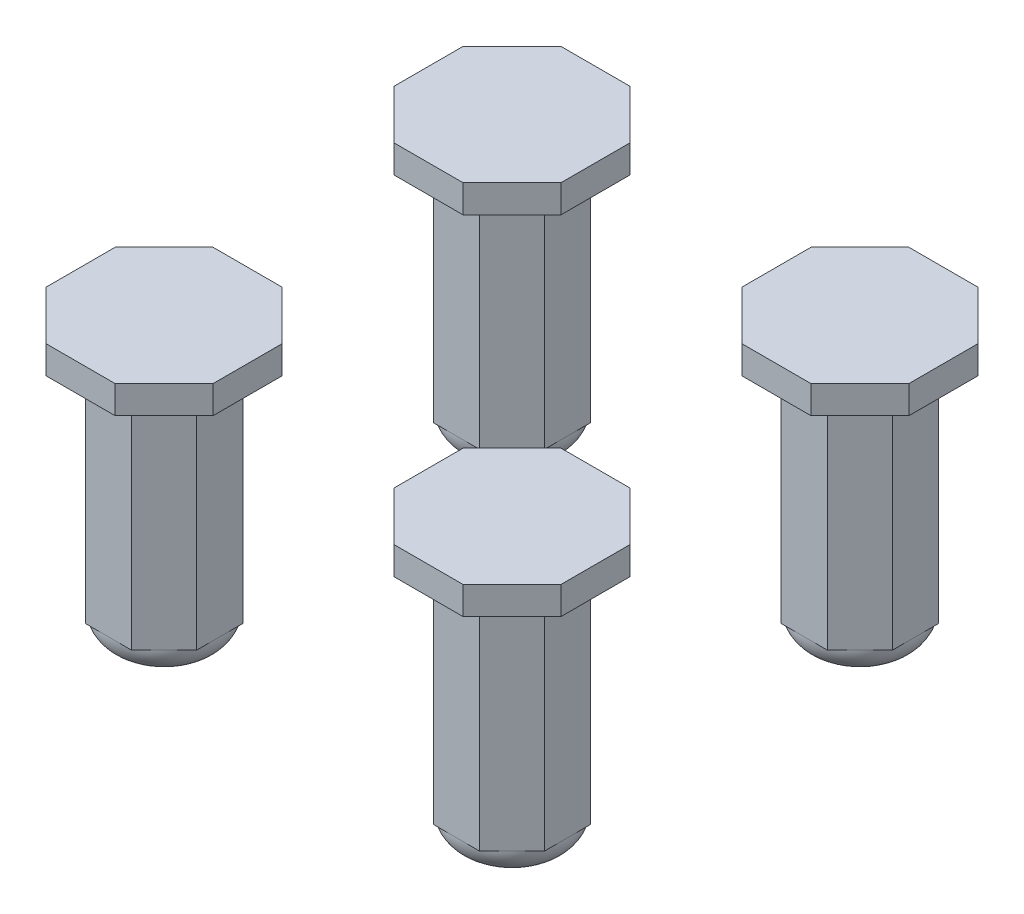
ISO-10303-21;
HEADER;
FILE_DESCRIPTION(('STEP AP214'),'2;1');
FILE_NAME('part.step','',(''),(''),'','','');
FILE_SCHEMA(('AUTOMOTIVE_DESIGN { 1 0 10303 214 1 1 1 1 }'));
ENDSEC;
DATA;
#1=APPLICATION_CONTEXT('core data for automotive mechanical design processes');
#2=APPLICATION_PROTOCOL_DEFINITION('international standard','automotive_design',2000,#1);
#3=PRODUCT_CONTEXT('',#1,'mechanical');
#4=PRODUCT('Part','Part','',(#3));
#5=PRODUCT_RELATED_PRODUCT_CATEGORY('part','',(#4));
#6=PRODUCT_DEFINITION_FORMATION('','',#4);
#7=PRODUCT_DEFINITION_CONTEXT('part definition',#1,'design');
#8=PRODUCT_DEFINITION('design','',#6,#7);
#9=PRODUCT_DEFINITION_SHAPE('','',#8);
#10=(LENGTH_UNIT() NAMED_UNIT(*) SI_UNIT(.MILLI.,.METRE.));
#11=(NAMED_UNIT(*) PLANE_ANGLE_UNIT() SI_UNIT($,.RADIAN.));
#12=(NAMED_UNIT(*) SI_UNIT($,.STERADIAN.) SOLID_ANGLE_UNIT());
#13=UNCERTAINTY_MEASURE_WITH_UNIT(LENGTH_MEASURE(1.E-05),#10,'distance_accuracy_value','');
#14=(GEOMETRIC_REPRESENTATION_CONTEXT(3) GLOBAL_UNCERTAINTY_ASSIGNED_CONTEXT((#13)) GLOBAL_UNIT_ASSIGNED_CONTEXT((#10,
#11,#12)) REPRESENTATION_CONTEXT('',''));
#15=CARTESIAN_POINT('',(0.,0.,0.));
#16=DIRECTION('',(0.,0.,1.));
#17=DIRECTION('',(1.,0.,0.));
#18=AXIS2_PLACEMENT_3D('',#15,#16,#17);
#19=CARTESIAN_POINT('',(0.,0.,0.));
#20=DIRECTION('',(0.,1.,0.));
#21=DIRECTION('',(0.,0.,1.));
#22=AXIS2_PLACEMENT_3D('',#19,#20,#21);
#23=PLANE('',#22);
#24=CARTESIAN_POINT('',(2.5,0.,2.5));
#25=DIRECTION('',(0.,-1.,0.));
#26=DIRECTION('',(0.,0.,-1.));
#27=AXIS2_PLACEMENT_3D('',#24,#25,#26);
#28=CIRCLE('',#27,0.4);
#29=CARTESIAN_POINT('',(2.5,0.,2.1));
#30=VERTEX_POINT('',#29);
#31=CARTESIAN_POINT('',(2.78284271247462,0.,2.21715728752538));
#32=VERTEX_POINT('',#31);
#33=EDGE_CURVE('E201',#30,#32,#28,.T.);
#34=ORIENTED_EDGE('',*,*,#33,.F.);
#35=DIRECTION('',(-1.,0.,0.));
#36=VECTOR('',#35,1.);
#37=CARTESIAN_POINT('',(2.66568542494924,0.,2.1));
#38=LINE('',#37,#36);
#39=CARTESIAN_POINT('',(2.66568542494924,0.,2.1));
#40=VERTEX_POINT('',#39);
#41=EDGE_CURVE('E181',#40,#30,#38,.T.);
#42=ORIENTED_EDGE('',*,*,#41,.F.);
#43=DIRECTION('',(-0.707106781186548,0.,-0.707106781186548));
#44=VECTOR('',#43,1.);
#45=CARTESIAN_POINT('',(2.9,0.,2.33431457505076));
#46=LINE('',#45,#44);
#47=EDGE_CURVE('E202',#32,#40,#46,.T.);
#48=ORIENTED_EDGE('',*,*,#47,.F.);
#49=EDGE_LOOP('',(#34,#42,#48));
#50=FACE_BOUND('',#49,.T.);
#51=ADVANCED_FACE('F43',(#50),#23,.F.);
#52=CARTESIAN_POINT('',(2.9,0.,2.5));
#53=VERTEX_POINT('',#52);
#54=EDGE_CURVE('E51',#32,#53,#28,.T.);
#55=ORIENTED_EDGE('',*,*,#54,.F.);
#56=CARTESIAN_POINT('',(2.9,0.,2.33431457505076));
#57=VERTEX_POINT('',#56);
#58=EDGE_CURVE('E199',#57,#32,#46,.T.);
#59=ORIENTED_EDGE('',*,*,#58,.F.);
#60=DIRECTION('',(0.,0.,-1.));
#61=VECTOR('',#60,1.);
#62=CARTESIAN_POINT('',(2.9,0.,2.66568542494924));
#63=LINE('',#62,#61);
#64=EDGE_CURVE('E312',#53,#57,#63,.T.);
#65=ORIENTED_EDGE('',*,*,#64,.F.);
#66=EDGE_LOOP('',(#55,#59,#65));
#67=FACE_BOUND('',#66,.T.);
#68=ADVANCED_FACE('F348',(#67),#23,.F.);
#69=CARTESIAN_POINT('',(2.78284271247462,0.,2.78284271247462));
#70=VERTEX_POINT('',#69);
#71=EDGE_CURVE('E350',#53,#70,#28,.T.);
#72=ORIENTED_EDGE('',*,*,#71,.F.);
#73=CARTESIAN_POINT('',(2.9,0.,2.66568542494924));
#74=VERTEX_POINT('',#73);
#75=EDGE_CURVE('E272',#74,#53,#63,.T.);
#76=ORIENTED_EDGE('',*,*,#75,.F.);
#77=DIRECTION('',(0.707106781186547,0.,-0.707106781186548));
#78=VECTOR('',#77,1.);
#79=CARTESIAN_POINT('',(2.66568542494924,0.,2.9));
#80=LINE('',#79,#78);
#81=EDGE_CURVE('E308',#70,#74,#80,.T.);
#82=ORIENTED_EDGE('',*,*,#81,.F.);
#83=EDGE_LOOP('',(#72,#76,#82));
#84=FACE_BOUND('',#83,.T.);
#85=ADVANCED_FACE('F383',(#84),#23,.F.);
#86=CARTESIAN_POINT('',(2.5,0.,2.9));
#87=VERTEX_POINT('',#86);
#88=EDGE_CURVE('E351',#70,#87,#28,.T.);
#89=ORIENTED_EDGE('',*,*,#88,.F.);
#90=CARTESIAN_POINT('',(2.66568542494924,0.,2.9));
#91=VERTEX_POINT('',#90);
#92=EDGE_CURVE('E309',#91,#70,#80,.T.);
#93=ORIENTED_EDGE('',*,*,#92,.F.);
#94=DIRECTION('',(1.,0.,0.));
#95=VECTOR('',#94,1.);
#96=CARTESIAN_POINT('',(2.33431457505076,0.,2.9));
#97=LINE('',#96,#95);
#98=EDGE_CURVE('E304',#87,#91,#97,.T.);
#99=ORIENTED_EDGE('',*,*,#98,.F.);
#100=EDGE_LOOP('',(#89,#93,#99));
#101=FACE_BOUND('',#100,.T.);
#102=ADVANCED_FACE('F387',(#101),#23,.F.);
#103=CARTESIAN_POINT('',(2.21715728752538,0.,2.78284271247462));
#104=VERTEX_POINT('',#103);
#105=EDGE_CURVE('E353',#87,#104,#28,.T.);
#106=ORIENTED_EDGE('',*,*,#105,.F.);
#107=CARTESIAN_POINT('',(2.33431457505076,0.,2.9));
#108=VERTEX_POINT('',#107);
#109=EDGE_CURVE('E305',#108,#87,#97,.T.);
#110=ORIENTED_EDGE('',*,*,#109,.F.);
#111=DIRECTION('',(0.707106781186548,0.,0.707106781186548));
#112=VECTOR('',#111,1.);
#113=CARTESIAN_POINT('',(2.1,0.,2.66568542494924));
#114=LINE('',#113,#112);
#115=EDGE_CURVE('E300',#104,#108,#114,.T.);
#116=ORIENTED_EDGE('',*,*,#115,.F.);
#117=EDGE_LOOP('',(#106,#110,#116));
#118=FACE_BOUND('',#117,.T.);
#119=ADVANCED_FACE('F361',(#118),#23,.F.);
#120=CARTESIAN_POINT('',(2.1,0.,2.5));
#121=VERTEX_POINT('',#120);
#122=EDGE_CURVE('E208',#104,#121,#28,.T.);
#123=ORIENTED_EDGE('',*,*,#122,.F.);
#124=CARTESIAN_POINT('',(2.1,0.,2.66568542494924));
#125=VERTEX_POINT('',#124);
#126=EDGE_CURVE('E301',#125,#104,#114,.T.);
#127=ORIENTED_EDGE('',*,*,#126,.F.);
#128=DIRECTION('',(0.,0.,1.));
#129=VECTOR('',#128,1.);
#130=CARTESIAN_POINT('',(2.1,0.,2.33431457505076));
#131=LINE('',#130,#129);
#132=EDGE_CURVE('E296',#121,#125,#131,.T.);
#133=ORIENTED_EDGE('',*,*,#132,.F.);
#134=EDGE_LOOP('',(#123,#127,#133));
#135=FACE_BOUND('',#134,.T.);
#136=ADVANCED_FACE('F358',(#135),#23,.F.);
#137=CARTESIAN_POINT('',(2.21715728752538,0.,2.21715728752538));
#138=VERTEX_POINT('',#137);
#139=EDGE_CURVE('E58',#121,#138,#28,.T.);
#140=ORIENTED_EDGE('',*,*,#139,.F.);
#141=CARTESIAN_POINT('',(2.1,0.,2.33431457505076));
#142=VERTEX_POINT('',#141);
#143=EDGE_CURVE('E297',#142,#121,#131,.T.);
#144=ORIENTED_EDGE('',*,*,#143,.F.);
#145=DIRECTION('',(-0.707106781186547,0.,0.707106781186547));
#146=VECTOR('',#145,1.);
#147=CARTESIAN_POINT('',(2.33431457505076,0.,2.1));
#148=LINE('',#147,#146);
#149=EDGE_CURVE('E191',#138,#142,#148,.T.);
#150=ORIENTED_EDGE('',*,*,#149,.F.);
#151=EDGE_LOOP('',(#140,#144,#150));
#152=FACE_BOUND('',#151,.T.);
#153=ADVANCED_FACE('F369',(#152),#23,.F.);
#154=CARTESIAN_POINT('',(2.9,1.6,2.33431457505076));
#155=DIRECTION('',(-0.707106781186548,0.,0.707106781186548));
#156=DIRECTION('',(0.707106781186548,0.,0.707106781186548));
#157=AXIS2_PLACEMENT_3D('',#154,#155,#156);
#158=PLANE('',#157);
#159=ORIENTED_EDGE('',*,*,#58,.T.);
#160=ORIENTED_EDGE('',*,*,#47,.T.);
#161=DIRECTION('',(0.,-1.,0.));
#162=VECTOR('',#161,1.);
#163=CARTESIAN_POINT('',(2.66568542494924,1.6,2.1));
#164=LINE('',#163,#162);
#165=CARTESIAN_POINT('',(2.66568542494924,1.6,2.1));
#166=VERTEX_POINT('',#165);
#167=EDGE_CURVE('E187',#166,#40,#164,.T.);
#168=ORIENTED_EDGE('',*,*,#167,.F.);
#169=DIRECTION('',(-0.707106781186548,0.,-0.707106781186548));
#170=VECTOR('',#169,1.);
#171=CARTESIAN_POINT('',(2.9,1.6,2.33431457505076));
#172=LINE('',#171,#170);
#173=CARTESIAN_POINT('',(2.9,1.6,2.33431457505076));
#174=VERTEX_POINT('',#173);
#175=EDGE_CURVE('E268',#174,#166,#172,.T.);
#176=ORIENTED_EDGE('',*,*,#175,.F.);
#177=DIRECTION('',(0.,-1.,0.));
#178=VECTOR('',#177,1.);
#179=CARTESIAN_POINT('',(2.9,1.6,2.33431457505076));
#180=LINE('',#179,#178);
#181=EDGE_CURVE('E293',#174,#57,#180,.T.);
#182=ORIENTED_EDGE('',*,*,#181,.T.);
#183=EDGE_LOOP('',(#159,#160,#168,#176,#182));
#184=FACE_BOUND('',#183,.T.);
#185=ADVANCED_FACE('F337',(#184),#158,.F.);
#186=CARTESIAN_POINT('',(2.66568542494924,1.6,2.1));
#187=DIRECTION('',(0.,0.,1.));
#188=DIRECTION('',(1.,0.,0.));
#189=AXIS2_PLACEMENT_3D('',#186,#187,#188);
#190=PLANE('',#189);
#191=ORIENTED_EDGE('',*,*,#41,.T.);
#192=CARTESIAN_POINT('',(2.33431457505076,0.,2.1));
#193=VERTEX_POINT('',#192);
#194=EDGE_CURVE('E184',#30,#193,#38,.T.);
#195=ORIENTED_EDGE('',*,*,#194,.T.);
#196=DIRECTION('',(0.,-1.,0.));
#197=VECTOR('',#196,1.);
#198=CARTESIAN_POINT('',(2.33431457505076,1.6,2.1));
#199=LINE('',#198,#197);
#200=CARTESIAN_POINT('',(2.33431457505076,1.6,2.1));
#201=VERTEX_POINT('',#200);
#202=EDGE_CURVE('E209',#201,#193,#199,.T.);
#203=ORIENTED_EDGE('',*,*,#202,.F.);
#204=DIRECTION('',(-1.,0.,0.));
#205=VECTOR('',#204,1.);
#206=CARTESIAN_POINT('',(2.66568542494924,1.6,2.1));
#207=LINE('',#206,#205);
#208=EDGE_CURVE('E271',#166,#201,#207,.T.);
#209=ORIENTED_EDGE('',*,*,#208,.F.);
#210=ORIENTED_EDGE('',*,*,#167,.T.);
#211=EDGE_LOOP('',(#191,#195,#203,#209,#210));
#212=FACE_BOUND('',#211,.T.);
#213=ADVANCED_FACE('F183',(#212),#190,.F.);
#214=CARTESIAN_POINT('',(2.33431457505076,1.6,2.1));
#215=DIRECTION('',(0.707106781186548,0.,0.707106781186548));
#216=DIRECTION('',(0.707106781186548,0.,-0.707106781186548));
#217=AXIS2_PLACEMENT_3D('',#214,#215,#216);
#218=PLANE('',#217);
#219=EDGE_CURVE('E198',#193,#138,#148,.T.);
#220=ORIENTED_EDGE('',*,*,#219,.T.);
#221=ORIENTED_EDGE('',*,*,#149,.T.);
#222=DIRECTION('',(0.,-1.,0.));
#223=VECTOR('',#222,1.);
#224=CARTESIAN_POINT('',(2.1,1.6,2.33431457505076));
#225=LINE('',#224,#223);
#226=CARTESIAN_POINT('',(2.1,1.6,2.33431457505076));
#227=VERTEX_POINT('',#226);
#228=EDGE_CURVE('E329',#227,#142,#225,.T.);
#229=ORIENTED_EDGE('',*,*,#228,.F.);
#230=DIRECTION('',(-0.707106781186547,0.,0.707106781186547));
#231=VECTOR('',#230,1.);
#232=CARTESIAN_POINT('',(2.33431457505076,1.6,2.1));
#233=LINE('',#232,#231);
#234=EDGE_CURVE('E275',#201,#227,#233,.T.);
#235=ORIENTED_EDGE('',*,*,#234,.F.);
#236=ORIENTED_EDGE('',*,*,#202,.T.);
#237=EDGE_LOOP('',(#220,#221,#229,#235,#236));
#238=FACE_BOUND('',#237,.T.);
#239=ADVANCED_FACE('F334',(#238),#218,.F.);
#240=CARTESIAN_POINT('',(2.1,1.6,2.33431457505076));
#241=DIRECTION('',(1.,0.,0.));
#242=DIRECTION('',(0.,0.,-1.));
#243=AXIS2_PLACEMENT_3D('',#240,#241,#242);
#244=PLANE('',#243);
#245=ORIENTED_EDGE('',*,*,#143,.T.);
#246=ORIENTED_EDGE('',*,*,#132,.T.);
#247=DIRECTION('',(0.,-1.,0.));
#248=VECTOR('',#247,1.);
#249=CARTESIAN_POINT('',(2.1,1.6,2.66568542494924));
#250=LINE('',#249,#248);
#251=CARTESIAN_POINT('',(2.1,1.6,2.66568542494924));
#252=VERTEX_POINT('',#251);
#253=EDGE_CURVE('E326',#252,#125,#250,.T.);
#254=ORIENTED_EDGE('',*,*,#253,.F.);
#255=DIRECTION('',(0.,0.,1.));
#256=VECTOR('',#255,1.);
#257=CARTESIAN_POINT('',(2.1,1.6,2.33431457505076));
#258=LINE('',#257,#256);
#259=EDGE_CURVE('E278',#227,#252,#258,.T.);
#260=ORIENTED_EDGE('',*,*,#259,.F.);
#261=ORIENTED_EDGE('',*,*,#228,.T.);
#262=EDGE_LOOP('',(#245,#246,#254,#260,#261));
#263=FACE_BOUND('',#262,.T.);
#264=ADVANCED_FACE('F368',(#263),#244,.F.);
#265=CARTESIAN_POINT('',(2.1,1.6,2.66568542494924));
#266=DIRECTION('',(0.707106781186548,0.,-0.707106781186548));
#267=DIRECTION('',(-0.707106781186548,0.,-0.707106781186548));
#268=AXIS2_PLACEMENT_3D('',#265,#266,#267);
#269=PLANE('',#268);
#270=ORIENTED_EDGE('',*,*,#126,.T.);
#271=ORIENTED_EDGE('',*,*,#115,.T.);
#272=DIRECTION('',(0.,-1.,0.));
#273=VECTOR('',#272,1.);
#274=CARTESIAN_POINT('',(2.33431457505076,1.6,2.9));
#275=LINE('',#274,#273);
#276=CARTESIAN_POINT('',(2.33431457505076,1.6,2.9));
#277=VERTEX_POINT('',#276);
#278=EDGE_CURVE('E323',#277,#108,#275,.T.);
#279=ORIENTED_EDGE('',*,*,#278,.F.);
#280=DIRECTION('',(0.707106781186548,0.,0.707106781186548));
#281=VECTOR('',#280,1.);
#282=CARTESIAN_POINT('',(2.1,1.6,2.66568542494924));
#283=LINE('',#282,#281);
#284=EDGE_CURVE('E281',#252,#277,#283,.T.);
#285=ORIENTED_EDGE('',*,*,#284,.F.);
#286=ORIENTED_EDGE('',*,*,#253,.T.);
#287=EDGE_LOOP('',(#270,#271,#279,#285,#286));
#288=FACE_BOUND('',#287,.T.);
#289=ADVANCED_FACE('F364',(#288),#269,.F.);
#290=CARTESIAN_POINT('',(2.33431457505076,1.6,2.9));
#291=DIRECTION('',(0.,0.,-1.));
#292=DIRECTION('',(-1.,0.,0.));
#293=AXIS2_PLACEMENT_3D('',#290,#291,#292);
#294=PLANE('',#293);
#295=ORIENTED_EDGE('',*,*,#109,.T.);
#296=ORIENTED_EDGE('',*,*,#98,.T.);
#297=DIRECTION('',(0.,-1.,0.));
#298=VECTOR('',#297,1.);
#299=CARTESIAN_POINT('',(2.66568542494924,1.6,2.9));
#300=LINE('',#299,#298);
#301=CARTESIAN_POINT('',(2.66568542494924,1.6,2.9));
#302=VERTEX_POINT('',#301);
#303=EDGE_CURVE('E320',#302,#91,#300,.T.);
#304=ORIENTED_EDGE('',*,*,#303,.F.);
#305=DIRECTION('',(1.,0.,0.));
#306=VECTOR('',#305,1.);
#307=CARTESIAN_POINT('',(2.33431457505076,1.6,2.9));
#308=LINE('',#307,#306);
#309=EDGE_CURVE('E284',#277,#302,#308,.T.);
#310=ORIENTED_EDGE('',*,*,#309,.F.);
#311=ORIENTED_EDGE('',*,*,#278,.T.);
#312=EDGE_LOOP('',(#295,#296,#304,#310,#311));
#313=FACE_BOUND('',#312,.T.);
#314=ADVANCED_FACE('F398',(#313),#294,.F.);
#315=CARTESIAN_POINT('',(2.66568542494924,1.6,2.9));
#316=DIRECTION('',(-0.707106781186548,0.,-0.707106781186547));
#317=DIRECTION('',(-0.707106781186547,0.,0.707106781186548));
#318=AXIS2_PLACEMENT_3D('',#315,#316,#317);
#319=PLANE('',#318);
#320=ORIENTED_EDGE('',*,*,#92,.T.);
#321=ORIENTED_EDGE('',*,*,#81,.T.);
#322=DIRECTION('',(0.,-1.,0.));
#323=VECTOR('',#322,1.);
#324=CARTESIAN_POINT('',(2.9,1.6,2.66568542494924));
#325=LINE('',#324,#323);
#326=CARTESIAN_POINT('',(2.9,1.6,2.66568542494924));
#327=VERTEX_POINT('',#326);
#328=EDGE_CURVE('E317',#327,#74,#325,.T.);
#329=ORIENTED_EDGE('',*,*,#328,.F.);
#330=DIRECTION('',(0.707106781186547,0.,-0.707106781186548));
#331=VECTOR('',#330,1.);
#332=CARTESIAN_POINT('',(2.66568542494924,1.6,2.9));
#333=LINE('',#332,#331);
#334=EDGE_CURVE('E287',#302,#327,#333,.T.);
#335=ORIENTED_EDGE('',*,*,#334,.F.);
#336=ORIENTED_EDGE('',*,*,#303,.T.);
#337=EDGE_LOOP('',(#320,#321,#329,#335,#336));
#338=FACE_BOUND('',#337,.T.);
#339=ADVANCED_FACE('F396',(#338),#319,.F.);
#340=CARTESIAN_POINT('',(2.9,1.6,2.66568542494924));
#341=DIRECTION('',(-1.,0.,0.));
#342=DIRECTION('',(0.,0.,1.));
#343=AXIS2_PLACEMENT_3D('',#340,#341,#342);
#344=PLANE('',#343);
#345=ORIENTED_EDGE('',*,*,#75,.T.);
#346=ORIENTED_EDGE('',*,*,#64,.T.);
#347=ORIENTED_EDGE('',*,*,#181,.F.);
#348=DIRECTION('',(0.,0.,-1.));
#349=VECTOR('',#348,1.);
#350=CARTESIAN_POINT('',(2.9,1.6,2.66568542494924));
#351=LINE('',#350,#349);
#352=EDGE_CURVE('E290',#327,#174,#351,.T.);
#353=ORIENTED_EDGE('',*,*,#352,.F.);
#354=ORIENTED_EDGE('',*,*,#328,.T.);
#355=EDGE_LOOP('',(#345,#346,#347,#353,#354));
#356=FACE_BOUND('',#355,.T.);
#357=ADVANCED_FACE('F343',(#356),#344,.F.);
#358=EDGE_CURVE('E196',#138,#30,#28,.T.);
#359=ORIENTED_EDGE('',*,*,#358,.F.);
#360=ORIENTED_EDGE('',*,*,#219,.F.);
#361=ORIENTED_EDGE('',*,*,#194,.F.);
#362=EDGE_LOOP('',(#359,#360,#361));
#363=FACE_BOUND('',#362,.T.);
#364=ADVANCED_FACE('F195',(#363),#23,.F.);
#365=CARTESIAN_POINT('',(0.,1.6,0.));
#366=DIRECTION('',(0.,1.,0.));
#367=DIRECTION('',(0.,0.,1.));
#368=AXIS2_PLACEMENT_3D('',#365,#366,#367);
#369=PLANE('',#368);
#370=DIRECTION('',(-0.707106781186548,0.,-0.707106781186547));
#371=VECTOR('',#370,1.);
#372=CARTESIAN_POINT('',(3.1,1.6,2.25147186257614));
#373=LINE('',#372,#371);
#374=CARTESIAN_POINT('',(3.1,1.6,2.25147186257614));
#375=VERTEX_POINT('',#374);
#376=CARTESIAN_POINT('',(2.74852813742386,1.6,1.9));
#377=VERTEX_POINT('',#376);
#378=EDGE_CURVE('E205',#375,#377,#373,.T.);
#379=ORIENTED_EDGE('',*,*,#378,.F.);
#380=DIRECTION('',(0.,0.,-1.));
#381=VECTOR('',#380,1.);
#382=CARTESIAN_POINT('',(3.1,1.6,2.74852813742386));
#383=LINE('',#382,#381);
#384=CARTESIAN_POINT('',(3.1,1.6,2.74852813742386));
#385=VERTEX_POINT('',#384);
#386=EDGE_CURVE('E215',#385,#375,#383,.T.);
#387=ORIENTED_EDGE('',*,*,#386,.F.);
#388=DIRECTION('',(0.707106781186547,0.,-0.707106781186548));
#389=VECTOR('',#388,1.);
#390=CARTESIAN_POINT('',(2.74852813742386,1.6,3.1));
#391=LINE('',#390,#389);
#392=CARTESIAN_POINT('',(2.74852813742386,1.6,3.1));
#393=VERTEX_POINT('',#392);
#394=EDGE_CURVE('E242',#393,#385,#391,.T.);
#395=ORIENTED_EDGE('',*,*,#394,.F.);
#396=DIRECTION('',(1.,0.,0.));
#397=VECTOR('',#396,1.);
#398=CARTESIAN_POINT('',(2.25147186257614,1.6,3.1));
#399=LINE('',#398,#397);
#400=CARTESIAN_POINT('',(2.25147186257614,1.6,3.1));
#401=VERTEX_POINT('',#400);
#402=EDGE_CURVE('E240',#401,#393,#399,.T.);
#403=ORIENTED_EDGE('',*,*,#402,.F.);
#404=DIRECTION('',(0.707106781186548,0.,0.707106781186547));
#405=VECTOR('',#404,1.);
#406=CARTESIAN_POINT('',(1.9,1.6,2.74852813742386));
#407=LINE('',#406,#405);
#408=CARTESIAN_POINT('',(1.9,1.6,2.74852813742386));
#409=VERTEX_POINT('',#408);
#410=EDGE_CURVE('E238',#409,#401,#407,.T.);
#411=ORIENTED_EDGE('',*,*,#410,.F.);
#412=DIRECTION('',(0.,0.,1.));
#413=VECTOR('',#412,1.);
#414=CARTESIAN_POINT('',(1.9,1.6,2.25147186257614));
#415=LINE('',#414,#413);
#416=CARTESIAN_POINT('',(1.9,1.6,2.25147186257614));
#417=VERTEX_POINT('',#416);
#418=EDGE_CURVE('E236',#417,#409,#415,.T.);
#419=ORIENTED_EDGE('',*,*,#418,.F.);
#420=DIRECTION('',(-0.707106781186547,0.,0.707106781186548));
#421=VECTOR('',#420,1.);
#422=CARTESIAN_POINT('',(2.25147186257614,1.6,1.9));
#423=LINE('',#422,#421);
#424=CARTESIAN_POINT('',(2.25147186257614,1.6,1.9));
#425=VERTEX_POINT('',#424);
#426=EDGE_CURVE('E234',#425,#417,#423,.T.);
#427=ORIENTED_EDGE('',*,*,#426,.F.);
#428=DIRECTION('',(-1.,0.,0.));
#429=VECTOR('',#428,1.);
#430=CARTESIAN_POINT('',(2.74852813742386,1.6,1.9));
#431=LINE('',#430,#429);
#432=EDGE_CURVE('E232',#377,#425,#431,.T.);
#433=ORIENTED_EDGE('',*,*,#432,.F.);
#434=EDGE_LOOP('',(#379,#387,#395,#403,#411,#419,#427,#433));
#435=FACE_BOUND('',#434,.T.);
#436=ORIENTED_EDGE('',*,*,#352,.T.);
#437=ORIENTED_EDGE('',*,*,#175,.T.);
#438=ORIENTED_EDGE('',*,*,#208,.T.);
#439=ORIENTED_EDGE('',*,*,#234,.T.);
#440=ORIENTED_EDGE('',*,*,#259,.T.);
#441=ORIENTED_EDGE('',*,*,#284,.T.);
#442=ORIENTED_EDGE('',*,*,#309,.T.);
#443=ORIENTED_EDGE('',*,*,#334,.T.);
#444=EDGE_LOOP('',(#436,#437,#438,#439,#440,#441,#442,#443));
#445=FACE_BOUND('',#444,.T.);
#446=ADVANCED_FACE('F339',(#435,#445),#369,.F.);
#447=CARTESIAN_POINT('',(3.1,1.8,2.25147186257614));
#448=DIRECTION('',(-0.707106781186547,0.,0.707106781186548));
#449=DIRECTION('',(0.707106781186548,0.,0.707106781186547));
#450=AXIS2_PLACEMENT_3D('',#447,#448,#449);
#451=PLANE('',#450);
#452=ORIENTED_EDGE('',*,*,#378,.T.);
#453=DIRECTION('',(0.,-1.,0.));
#454=VECTOR('',#453,1.);
#455=CARTESIAN_POINT('',(2.74852813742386,1.8,1.9));
#456=LINE('',#455,#454);
#457=CARTESIAN_POINT('',(2.74852813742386,1.8,1.9));
#458=VERTEX_POINT('',#457);
#459=EDGE_CURVE('E265',#458,#377,#456,.T.);
#460=ORIENTED_EDGE('',*,*,#459,.F.);
#461=DIRECTION('',(-0.707106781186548,0.,-0.707106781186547));
#462=VECTOR('',#461,1.);
#463=CARTESIAN_POINT('',(3.1,1.8,2.25147186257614));
#464=LINE('',#463,#462);
#465=CARTESIAN_POINT('',(3.1,1.8,2.25147186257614));
#466=VERTEX_POINT('',#465);
#467=EDGE_CURVE('E211',#466,#458,#464,.T.);
#468=ORIENTED_EDGE('',*,*,#467,.F.);
#469=DIRECTION('',(0.,-1.,0.));
#470=VECTOR('',#469,1.);
#471=CARTESIAN_POINT('',(3.1,1.8,2.25147186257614));
#472=LINE('',#471,#470);
#473=EDGE_CURVE('E229',#466,#375,#472,.T.);
#474=ORIENTED_EDGE('',*,*,#473,.T.);
#475=EDGE_LOOP('',(#452,#460,#468,#474));
#476=FACE_BOUND('',#475,.T.);
#477=ADVANCED_FACE('F538',(#476),#451,.F.);
#478=CARTESIAN_POINT('',(2.74852813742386,1.8,1.9));
#479=DIRECTION('',(0.,0.,1.));
#480=DIRECTION('',(1.,0.,0.));
#481=AXIS2_PLACEMENT_3D('',#478,#479,#480);
#482=PLANE('',#481);
#483=ORIENTED_EDGE('',*,*,#432,.T.);
#484=DIRECTION('',(0.,-1.,0.));
#485=VECTOR('',#484,1.);
#486=CARTESIAN_POINT('',(2.25147186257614,1.8,1.9));
#487=LINE('',#486,#485);
#488=CARTESIAN_POINT('',(2.25147186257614,1.8,1.9));
#489=VERTEX_POINT('',#488);
#490=EDGE_CURVE('E262',#489,#425,#487,.T.);
#491=ORIENTED_EDGE('',*,*,#490,.F.);
#492=DIRECTION('',(-1.,0.,0.));
#493=VECTOR('',#492,1.);
#494=CARTESIAN_POINT('',(2.74852813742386,1.8,1.9));
#495=LINE('',#494,#493);
#496=EDGE_CURVE('E214',#458,#489,#495,.T.);
#497=ORIENTED_EDGE('',*,*,#496,.F.);
#498=ORIENTED_EDGE('',*,*,#459,.T.);
#499=EDGE_LOOP('',(#483,#491,#497,#498));
#500=FACE_BOUND('',#499,.T.);
#501=ADVANCED_FACE('F530',(#500),#482,.F.);
#502=CARTESIAN_POINT('',(2.25147186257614,1.8,1.9));
#503=DIRECTION('',(0.707106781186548,0.,0.707106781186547));
#504=DIRECTION('',(0.707106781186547,0.,-0.707106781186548));
#505=AXIS2_PLACEMENT_3D('',#502,#503,#504);
#506=PLANE('',#505);
#507=ORIENTED_EDGE('',*,*,#426,.T.);
#508=DIRECTION('',(0.,-1.,0.));
#509=VECTOR('',#508,1.);
#510=CARTESIAN_POINT('',(1.9,1.8,2.25147186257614));
#511=LINE('',#510,#509);
#512=CARTESIAN_POINT('',(1.9,1.8,2.25147186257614));
#513=VERTEX_POINT('',#512);
#514=EDGE_CURVE('E259',#513,#417,#511,.T.);
#515=ORIENTED_EDGE('',*,*,#514,.F.);
#516=DIRECTION('',(-0.707106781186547,0.,0.707106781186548));
#517=VECTOR('',#516,1.);
#518=CARTESIAN_POINT('',(2.25147186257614,1.8,1.9));
#519=LINE('',#518,#517);
#520=EDGE_CURVE('E217',#489,#513,#519,.T.);
#521=ORIENTED_EDGE('',*,*,#520,.F.);
#522=ORIENTED_EDGE('',*,*,#490,.T.);
#523=EDGE_LOOP('',(#507,#515,#521,#522));
#524=FACE_BOUND('',#523,.T.);
#525=ADVANCED_FACE('F522',(#524),#506,.F.);
#526=CARTESIAN_POINT('',(1.9,1.8,2.25147186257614));
#527=DIRECTION('',(1.,0.,0.));
#528=DIRECTION('',(0.,0.,-1.));
#529=AXIS2_PLACEMENT_3D('',#526,#527,#528);
#530=PLANE('',#529);
#531=ORIENTED_EDGE('',*,*,#418,.T.);
#532=DIRECTION('',(0.,-1.,0.));
#533=VECTOR('',#532,1.);
#534=CARTESIAN_POINT('',(1.9,1.8,2.74852813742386));
#535=LINE('',#534,#533);
#536=CARTESIAN_POINT('',(1.9,1.8,2.74852813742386));
#537=VERTEX_POINT('',#536);
#538=EDGE_CURVE('E256',#537,#409,#535,.T.);
#539=ORIENTED_EDGE('',*,*,#538,.F.);
#540=DIRECTION('',(0.,0.,1.));
#541=VECTOR('',#540,1.);
#542=CARTESIAN_POINT('',(1.9,1.8,2.25147186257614));
#543=LINE('',#542,#541);
#544=EDGE_CURVE('E219',#513,#537,#543,.T.);
#545=ORIENTED_EDGE('',*,*,#544,.F.);
#546=ORIENTED_EDGE('',*,*,#514,.T.);
#547=EDGE_LOOP('',(#531,#539,#545,#546));
#548=FACE_BOUND('',#547,.T.);
#549=ADVANCED_FACE('F514',(#548),#530,.F.);
#550=CARTESIAN_POINT('',(1.9,1.8,2.74852813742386));
#551=DIRECTION('',(0.707106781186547,0.,-0.707106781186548));
#552=DIRECTION('',(-0.707106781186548,0.,-0.707106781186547));
#553=AXIS2_PLACEMENT_3D('',#550,#551,#552);
#554=PLANE('',#553);
#555=ORIENTED_EDGE('',*,*,#410,.T.);
#556=DIRECTION('',(0.,-1.,0.));
#557=VECTOR('',#556,1.);
#558=CARTESIAN_POINT('',(2.25147186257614,1.8,3.1));
#559=LINE('',#558,#557);
#560=CARTESIAN_POINT('',(2.25147186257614,1.8,3.1));
#561=VERTEX_POINT('',#560);
#562=EDGE_CURVE('E253',#561,#401,#559,.T.);
#563=ORIENTED_EDGE('',*,*,#562,.F.);
#564=DIRECTION('',(0.707106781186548,0.,0.707106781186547));
#565=VECTOR('',#564,1.);
#566=CARTESIAN_POINT('',(1.9,1.8,2.74852813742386));
#567=LINE('',#566,#565);
#568=EDGE_CURVE('E221',#537,#561,#567,.T.);
#569=ORIENTED_EDGE('',*,*,#568,.F.);
#570=ORIENTED_EDGE('',*,*,#538,.T.);
#571=EDGE_LOOP('',(#555,#563,#569,#570));
#572=FACE_BOUND('',#571,.T.);
#573=ADVANCED_FACE('F506',(#572),#554,.F.);
#574=CARTESIAN_POINT('',(2.25147186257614,1.8,3.1));
#575=DIRECTION('',(0.,0.,-1.));
#576=DIRECTION('',(-1.,0.,0.));
#577=AXIS2_PLACEMENT_3D('',#574,#575,#576);
#578=PLANE('',#577);
#579=ORIENTED_EDGE('',*,*,#402,.T.);
#580=DIRECTION('',(0.,-1.,0.));
#581=VECTOR('',#580,1.);
#582=CARTESIAN_POINT('',(2.74852813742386,1.8,3.1));
#583=LINE('',#582,#581);
#584=CARTESIAN_POINT('',(2.74852813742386,1.8,3.1));
#585=VERTEX_POINT('',#584);
#586=EDGE_CURVE('E250',#585,#393,#583,.T.);
#587=ORIENTED_EDGE('',*,*,#586,.F.);
#588=DIRECTION('',(1.,0.,0.));
#589=VECTOR('',#588,1.);
#590=CARTESIAN_POINT('',(2.25147186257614,1.8,3.1));
#591=LINE('',#590,#589);
#592=EDGE_CURVE('E223',#561,#585,#591,.T.);
#593=ORIENTED_EDGE('',*,*,#592,.F.);
#594=ORIENTED_EDGE('',*,*,#562,.T.);
#595=EDGE_LOOP('',(#579,#587,#593,#594));
#596=FACE_BOUND('',#595,.T.);
#597=ADVANCED_FACE('F498',(#596),#578,.F.);
#598=CARTESIAN_POINT('',(2.74852813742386,1.8,3.1));
#599=DIRECTION('',(-0.707106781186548,0.,-0.707106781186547));
#600=DIRECTION('',(-0.707106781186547,0.,0.707106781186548));
#601=AXIS2_PLACEMENT_3D('',#598,#599,#600);
#602=PLANE('',#601);
#603=ORIENTED_EDGE('',*,*,#394,.T.);
#604=DIRECTION('',(0.,-1.,0.));
#605=VECTOR('',#604,1.);
#606=CARTESIAN_POINT('',(3.1,1.8,2.74852813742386));
#607=LINE('',#606,#605);
#608=CARTESIAN_POINT('',(3.1,1.8,2.74852813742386));
#609=VERTEX_POINT('',#608);
#610=EDGE_CURVE('E247',#609,#385,#607,.T.);
#611=ORIENTED_EDGE('',*,*,#610,.F.);
#612=DIRECTION('',(0.707106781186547,0.,-0.707106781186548));
#613=VECTOR('',#612,1.);
#614=CARTESIAN_POINT('',(2.74852813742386,1.8,3.1));
#615=LINE('',#614,#613);
#616=EDGE_CURVE('E225',#585,#609,#615,.T.);
#617=ORIENTED_EDGE('',*,*,#616,.F.);
#618=ORIENTED_EDGE('',*,*,#586,.T.);
#619=EDGE_LOOP('',(#603,#611,#617,#618));
#620=FACE_BOUND('',#619,.T.);
#621=ADVANCED_FACE('F490',(#620),#602,.F.);
#622=CARTESIAN_POINT('',(3.1,1.8,2.74852813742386));
#623=DIRECTION('',(-1.,0.,0.));
#624=DIRECTION('',(0.,0.,1.));
#625=AXIS2_PLACEMENT_3D('',#622,#623,#624);
#626=PLANE('',#625);
#627=ORIENTED_EDGE('',*,*,#386,.T.);
#628=ORIENTED_EDGE('',*,*,#473,.F.);
#629=DIRECTION('',(0.,0.,-1.));
#630=VECTOR('',#629,1.);
#631=CARTESIAN_POINT('',(3.1,1.8,2.74852813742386));
#632=LINE('',#631,#630);
#633=EDGE_CURVE('E227',#609,#466,#632,.T.);
#634=ORIENTED_EDGE('',*,*,#633,.F.);
#635=ORIENTED_EDGE('',*,*,#610,.T.);
#636=EDGE_LOOP('',(#627,#628,#634,#635));
#637=FACE_BOUND('',#636,.T.);
#638=ADVANCED_FACE('F482',(#637),#626,.F.);
#639=CARTESIAN_POINT('',(0.,1.8,0.));
#640=DIRECTION('',(0.,1.,0.));
#641=DIRECTION('',(0.,0.,1.));
#642=AXIS2_PLACEMENT_3D('',#639,#640,#641);
#643=PLANE('',#642);
#644=ORIENTED_EDGE('',*,*,#467,.T.);
#645=ORIENTED_EDGE('',*,*,#496,.T.);
#646=ORIENTED_EDGE('',*,*,#520,.T.);
#647=ORIENTED_EDGE('',*,*,#544,.T.);
#648=ORIENTED_EDGE('',*,*,#568,.T.);
#649=ORIENTED_EDGE('',*,*,#592,.T.);
#650=ORIENTED_EDGE('',*,*,#616,.T.);
#651=ORIENTED_EDGE('',*,*,#633,.T.);
#652=EDGE_LOOP('',(#644,#645,#646,#647,#648,#649,#650,#651));
#653=FACE_BOUND('',#652,.T.);
#654=ADVANCED_FACE('F465',(#653),#643,.T.);
#655=CARTESIAN_POINT('',(2.5,-0.2,2.5));
#656=DIRECTION('',(0.,-1.,0.));
#657=DIRECTION('',(0.,0.,-1.));
#658=AXIS2_PLACEMENT_3D('',#655,#656,#657);
#659=PLANE('',#658);
#660=CARTESIAN_POINT('',(2.5,-0.2,2.5));
#661=DIRECTION('',(0.,-1.,0.));
#662=DIRECTION('',(0.,0.,-1.));
#663=AXIS2_PLACEMENT_3D('',#660,#661,#662);
#664=CIRCLE('',#663,0.2);
#665=CARTESIAN_POINT('',(2.5,-0.2,2.3));
#666=VERTEX_POINT('',#665);
#667=EDGE_CURVE('E12',#666,#666,#664,.T.);
#668=ORIENTED_EDGE('',*,*,#667,.T.);
#669=EDGE_LOOP('',(#668));
#670=FACE_BOUND('',#669,.T.);
#671=ADVANCED_FACE('F460',(#670),#659,.T.);
#672=CARTESIAN_POINT('',(2.5,0.,2.5));
#673=DIRECTION('',(0.,-1.,0.));
#674=DIRECTION('',(0.,0.,-1.));
#675=AXIS2_PLACEMENT_3D('',#672,#673,#674);
#676=TOROIDAL_SURFACE('',#675,0.2,0.2);
#677=ORIENTED_EDGE('',*,*,#139,.T.);
#678=ORIENTED_EDGE('',*,*,#358,.T.);
#679=ORIENTED_EDGE('',*,*,#33,.T.);
#680=ORIENTED_EDGE('',*,*,#54,.T.);
#681=ORIENTED_EDGE('',*,*,#71,.T.);
#682=ORIENTED_EDGE('',*,*,#88,.T.);
#683=ORIENTED_EDGE('',*,*,#105,.T.);
#684=ORIENTED_EDGE('',*,*,#122,.T.);
#685=EDGE_LOOP('',(#677,#678,#679,#680,#681,#682,#683,#684));
#686=FACE_BOUND('',#685,.T.);
#687=ORIENTED_EDGE('',*,*,#667,.F.);
#688=EDGE_LOOP('',(#687));
#689=FACE_BOUND('',#688,.T.);
#690=ADVANCED_FACE('F45',(#686,#689),#676,.T.);
#691=CLOSED_SHELL('',(#51,#68,#85,#102,#119,#136,#153,#185,#213,#239,#264,#289,#314,#339,#357,
#364,#446,#477,#501,#525,#549,#573,#597,#621,#638,#654,#671,#690));
#692=MANIFOLD_SOLID_BREP('B2',#691);
#693=CARTESIAN_POINT('',(0.,0.,0.));
#694=DIRECTION('',(0.,1.,0.));
#695=DIRECTION('',(0.,0.,1.));
#696=AXIS2_PLACEMENT_3D('',#693,#694,#695);
#697=PLANE('',#696);
#698=CARTESIAN_POINT('',(0.,0.,2.5));
#699=DIRECTION('',(0.,-1.,0.));
#700=DIRECTION('',(0.,0.,-1.));
#701=AXIS2_PLACEMENT_3D('',#698,#699,#700);
#702=CIRCLE('',#701,0.400000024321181);
#703=CARTESIAN_POINT('',(0.,0.,2.09999997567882));
#704=VERTEX_POINT('',#703);
#705=CARTESIAN_POINT('',(0.282842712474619,0.,2.21715728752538));
#706=VERTEX_POINT('',#705);
#707=EDGE_CURVE('E810',#704,#706,#702,.T.);
#708=ORIENTED_EDGE('',*,*,#707,.F.);
#709=DIRECTION('',(-1.,0.,0.));
#710=VECTOR('',#709,1.);
#711=CARTESIAN_POINT('',(0.165685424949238,0.,2.1));
#712=LINE('',#711,#710);
#713=CARTESIAN_POINT('',(0.165685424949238,0.,2.1));
#714=VERTEX_POINT('',#713);
#715=EDGE_CURVE('E790',#714,#704,#712,.T.);
#716=ORIENTED_EDGE('',*,*,#715,.F.);
#717=DIRECTION('',(-0.707106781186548,0.,-0.707106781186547));
#718=VECTOR('',#717,1.);
#719=CARTESIAN_POINT('',(0.4,0.,2.33431457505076));
#720=LINE('',#719,#718);
#721=EDGE_CURVE('E811',#706,#714,#720,.T.);
#722=ORIENTED_EDGE('',*,*,#721,.F.);
#723=EDGE_LOOP('',(#708,#716,#722));
#724=FACE_BOUND('',#723,.T.);
#725=ADVANCED_FACE('F652',(#724),#697,.F.);
#726=CARTESIAN_POINT('',(0.4,0.,2.5));
#727=VERTEX_POINT('',#726);
#728=EDGE_CURVE('E660',#706,#727,#702,.T.);
#729=ORIENTED_EDGE('',*,*,#728,.F.);
#730=CARTESIAN_POINT('',(0.4,0.,2.33431457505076));
#731=VERTEX_POINT('',#730);
#732=EDGE_CURVE('E808',#731,#706,#720,.T.);
#733=ORIENTED_EDGE('',*,*,#732,.F.);
#734=DIRECTION('',(0.,0.,-1.));
#735=VECTOR('',#734,1.);
#736=CARTESIAN_POINT('',(0.4,0.,2.66568542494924));
#737=LINE('',#736,#735);
#738=EDGE_CURVE('E921',#727,#731,#737,.T.);
#739=ORIENTED_EDGE('',*,*,#738,.F.);
#740=EDGE_LOOP('',(#729,#733,#739));
#741=FACE_BOUND('',#740,.T.);
#742=ADVANCED_FACE('F957',(#741),#697,.F.);
#743=CARTESIAN_POINT('',(0.28284271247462,0.,2.78284271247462));
#744=VERTEX_POINT('',#743);
#745=EDGE_CURVE('E959',#727,#744,#702,.T.);
#746=ORIENTED_EDGE('',*,*,#745,.F.);
#747=CARTESIAN_POINT('',(0.4,0.,2.66568542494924));
#748=VERTEX_POINT('',#747);
#749=EDGE_CURVE('E881',#748,#727,#737,.T.);
#750=ORIENTED_EDGE('',*,*,#749,.F.);
#751=DIRECTION('',(0.707106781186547,0.,-0.707106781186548));
#752=VECTOR('',#751,1.);
#753=CARTESIAN_POINT('',(0.165685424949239,0.,2.9));
#754=LINE('',#753,#752);
#755=EDGE_CURVE('E917',#744,#748,#754,.T.);
#756=ORIENTED_EDGE('',*,*,#755,.F.);
#757=EDGE_LOOP('',(#746,#750,#756));
#758=FACE_BOUND('',#757,.T.);
#759=ADVANCED_FACE('F992',(#758),#697,.F.);
#760=CARTESIAN_POINT('',(0.,0.,2.9));
#761=VERTEX_POINT('',#760);
#762=EDGE_CURVE('E960',#744,#761,#702,.T.);
#763=ORIENTED_EDGE('',*,*,#762,.F.);
#764=CARTESIAN_POINT('',(0.165685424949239,0.,2.9));
#765=VERTEX_POINT('',#764);
#766=EDGE_CURVE('E918',#765,#744,#754,.T.);
#767=ORIENTED_EDGE('',*,*,#766,.F.);
#768=DIRECTION('',(1.,0.,0.));
#769=VECTOR('',#768,1.);
#770=CARTESIAN_POINT('',(-0.165685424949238,0.,2.9));
#771=LINE('',#770,#769);
#772=EDGE_CURVE('E913',#761,#765,#771,.T.);
#773=ORIENTED_EDGE('',*,*,#772,.F.);
#774=EDGE_LOOP('',(#763,#767,#773));
#775=FACE_BOUND('',#774,.T.);
#776=ADVANCED_FACE('F996',(#775),#697,.F.);
#777=CARTESIAN_POINT('',(-0.282842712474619,0.,2.78284271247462));
#778=VERTEX_POINT('',#777);
#779=EDGE_CURVE('E962',#761,#778,#702,.T.);
#780=ORIENTED_EDGE('',*,*,#779,.F.);
#781=CARTESIAN_POINT('',(-0.165685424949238,0.,2.9));
#782=VERTEX_POINT('',#781);
#783=EDGE_CURVE('E914',#782,#761,#771,.T.);
#784=ORIENTED_EDGE('',*,*,#783,.F.);
#785=DIRECTION('',(0.707106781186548,0.,0.707106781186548));
#786=VECTOR('',#785,1.);
#787=CARTESIAN_POINT('',(-0.4,0.,2.66568542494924));
#788=LINE('',#787,#786);
#789=EDGE_CURVE('E909',#778,#782,#788,.T.);
#790=ORIENTED_EDGE('',*,*,#789,.F.);
#791=EDGE_LOOP('',(#780,#784,#790));
#792=FACE_BOUND('',#791,.T.);
#793=ADVANCED_FACE('F970',(#792),#697,.F.);
#794=CARTESIAN_POINT('',(-0.4,0.,2.5));
#795=VERTEX_POINT('',#794);
#796=EDGE_CURVE('E817',#778,#795,#702,.T.);
#797=ORIENTED_EDGE('',*,*,#796,.F.);
#798=CARTESIAN_POINT('',(-0.4,0.,2.66568542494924));
#799=VERTEX_POINT('',#798);
#800=EDGE_CURVE('E910',#799,#778,#788,.T.);
#801=ORIENTED_EDGE('',*,*,#800,.F.);
#802=DIRECTION('',(0.,0.,1.));
#803=VECTOR('',#802,1.);
#804=CARTESIAN_POINT('',(-0.4,0.,2.33431457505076));
#805=LINE('',#804,#803);
#806=EDGE_CURVE('E905',#795,#799,#805,.T.);
#807=ORIENTED_EDGE('',*,*,#806,.F.);
#808=EDGE_LOOP('',(#797,#801,#807));
#809=FACE_BOUND('',#808,.T.);
#810=ADVANCED_FACE('F967',(#809),#697,.F.);
#811=CARTESIAN_POINT('',(-0.282842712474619,0.,2.21715728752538));
#812=VERTEX_POINT('',#811);
#813=EDGE_CURVE('E667',#795,#812,#702,.T.);
#814=ORIENTED_EDGE('',*,*,#813,.F.);
#815=CARTESIAN_POINT('',(-0.4,0.,2.33431457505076));
#816=VERTEX_POINT('',#815);
#817=EDGE_CURVE('E906',#816,#795,#805,.T.);
#818=ORIENTED_EDGE('',*,*,#817,.F.);
#819=DIRECTION('',(-0.707106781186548,0.,0.707106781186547));
#820=VECTOR('',#819,1.);
#821=CARTESIAN_POINT('',(-0.165685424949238,0.,2.1));
#822=LINE('',#821,#820);
#823=EDGE_CURVE('E800',#812,#816,#822,.T.);
#824=ORIENTED_EDGE('',*,*,#823,.F.);
#825=EDGE_LOOP('',(#814,#818,#824));
#826=FACE_BOUND('',#825,.T.);
#827=ADVANCED_FACE('F978',(#826),#697,.F.);
#828=CARTESIAN_POINT('',(0.4,1.6,2.33431457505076));
#829=DIRECTION('',(-0.707106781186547,0.,0.707106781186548));
#830=DIRECTION('',(0.707106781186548,0.,0.707106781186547));
#831=AXIS2_PLACEMENT_3D('',#828,#829,#830);
#832=PLANE('',#831);
#833=ORIENTED_EDGE('',*,*,#732,.T.);
#834=ORIENTED_EDGE('',*,*,#721,.T.);
#835=DIRECTION('',(0.,-1.,0.));
#836=VECTOR('',#835,1.);
#837=CARTESIAN_POINT('',(0.165685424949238,1.6,2.1));
#838=LINE('',#837,#836);
#839=CARTESIAN_POINT('',(0.165685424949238,1.6,2.1));
#840=VERTEX_POINT('',#839);
#841=EDGE_CURVE('E796',#840,#714,#838,.T.);
#842=ORIENTED_EDGE('',*,*,#841,.F.);
#843=DIRECTION('',(-0.707106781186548,0.,-0.707106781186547));
#844=VECTOR('',#843,1.);
#845=CARTESIAN_POINT('',(0.4,1.6,2.33431457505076));
#846=LINE('',#845,#844);
#847=CARTESIAN_POINT('',(0.4,1.6,2.33431457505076));
#848=VERTEX_POINT('',#847);
#849=EDGE_CURVE('E877',#848,#840,#846,.T.);
#850=ORIENTED_EDGE('',*,*,#849,.F.);
#851=DIRECTION('',(0.,-1.,0.));
#852=VECTOR('',#851,1.);
#853=CARTESIAN_POINT('',(0.4,1.6,2.33431457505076));
#854=LINE('',#853,#852);
#855=EDGE_CURVE('E902',#848,#731,#854,.T.);
#856=ORIENTED_EDGE('',*,*,#855,.T.);
#857=EDGE_LOOP('',(#833,#834,#842,#850,#856));
#858=FACE_BOUND('',#857,.T.);
#859=ADVANCED_FACE('F946',(#858),#832,.F.);
#860=CARTESIAN_POINT('',(0.165685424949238,1.6,2.1));
#861=DIRECTION('',(0.,0.,1.));
#862=DIRECTION('',(1.,0.,0.));
#863=AXIS2_PLACEMENT_3D('',#860,#861,#862);
#864=PLANE('',#863);
#865=ORIENTED_EDGE('',*,*,#715,.T.);
#866=CARTESIAN_POINT('',(-0.165685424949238,0.,2.1));
#867=VERTEX_POINT('',#866);
#868=EDGE_CURVE('E793',#704,#867,#712,.T.);
#869=ORIENTED_EDGE('',*,*,#868,.T.);
#870=DIRECTION('',(0.,-1.,0.));
#871=VECTOR('',#870,1.);
#872=CARTESIAN_POINT('',(-0.165685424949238,1.6,2.1));
#873=LINE('',#872,#871);
#874=CARTESIAN_POINT('',(-0.165685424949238,1.6,2.1));
#875=VERTEX_POINT('',#874);
#876=EDGE_CURVE('E818',#875,#867,#873,.T.);
#877=ORIENTED_EDGE('',*,*,#876,.F.);
#878=DIRECTION('',(-1.,0.,0.));
#879=VECTOR('',#878,1.);
#880=CARTESIAN_POINT('',(0.165685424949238,1.6,2.1));
#881=LINE('',#880,#879);
#882=EDGE_CURVE('E880',#840,#875,#881,.T.);
#883=ORIENTED_EDGE('',*,*,#882,.F.);
#884=ORIENTED_EDGE('',*,*,#841,.T.);
#885=EDGE_LOOP('',(#865,#869,#877,#883,#884));
#886=FACE_BOUND('',#885,.T.);
#887=ADVANCED_FACE('F792',(#886),#864,.F.);
#888=CARTESIAN_POINT('',(-0.165685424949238,1.6,2.1));
#889=DIRECTION('',(0.707106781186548,0.,0.707106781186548));
#890=DIRECTION('',(0.707106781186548,0.,-0.707106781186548));
#891=AXIS2_PLACEMENT_3D('',#888,#889,#890);
#892=PLANE('',#891);
#893=EDGE_CURVE('E807',#867,#812,#822,.T.);
#894=ORIENTED_EDGE('',*,*,#893,.T.);
#895=ORIENTED_EDGE('',*,*,#823,.T.);
#896=DIRECTION('',(0.,-1.,0.));
#897=VECTOR('',#896,1.);
#898=CARTESIAN_POINT('',(-0.4,1.6,2.33431457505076));
#899=LINE('',#898,#897);
#900=CARTESIAN_POINT('',(-0.4,1.6,2.33431457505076));
#901=VERTEX_POINT('',#900);
#902=EDGE_CURVE('E938',#901,#816,#899,.T.);
#903=ORIENTED_EDGE('',*,*,#902,.F.);
#904=DIRECTION('',(-0.707106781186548,0.,0.707106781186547));
#905=VECTOR('',#904,1.);
#906=CARTESIAN_POINT('',(-0.165685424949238,1.6,2.1));
#907=LINE('',#906,#905);
#908=EDGE_CURVE('E884',#875,#901,#907,.T.);
#909=ORIENTED_EDGE('',*,*,#908,.F.);
#910=ORIENTED_EDGE('',*,*,#876,.T.);
#911=EDGE_LOOP('',(#894,#895,#903,#909,#910));
#912=FACE_BOUND('',#911,.T.);
#913=ADVANCED_FACE('F943',(#912),#892,.F.);
#914=CARTESIAN_POINT('',(-0.4,1.6,2.33431457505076));
#915=DIRECTION('',(1.,0.,0.));
#916=DIRECTION('',(0.,0.,-1.));
#917=AXIS2_PLACEMENT_3D('',#914,#915,#916);
#918=PLANE('',#917);
#919=ORIENTED_EDGE('',*,*,#817,.T.);
#920=ORIENTED_EDGE('',*,*,#806,.T.);
#921=DIRECTION('',(0.,-1.,0.));
#922=VECTOR('',#921,1.);
#923=CARTESIAN_POINT('',(-0.4,1.6,2.66568542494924));
#924=LINE('',#923,#922);
#925=CARTESIAN_POINT('',(-0.4,1.6,2.66568542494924));
#926=VERTEX_POINT('',#925);
#927=EDGE_CURVE('E935',#926,#799,#924,.T.);
#928=ORIENTED_EDGE('',*,*,#927,.F.);
#929=DIRECTION('',(0.,0.,1.));
#930=VECTOR('',#929,1.);
#931=CARTESIAN_POINT('',(-0.4,1.6,2.33431457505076));
#932=LINE('',#931,#930);
#933=EDGE_CURVE('E887',#901,#926,#932,.T.);
#934=ORIENTED_EDGE('',*,*,#933,.F.);
#935=ORIENTED_EDGE('',*,*,#902,.T.);
#936=EDGE_LOOP('',(#919,#920,#928,#934,#935));
#937=FACE_BOUND('',#936,.T.);
#938=ADVANCED_FACE('F977',(#937),#918,.F.);
#939=CARTESIAN_POINT('',(-0.4,1.6,2.66568542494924));
#940=DIRECTION('',(0.707106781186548,0.,-0.707106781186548));
#941=DIRECTION('',(-0.707106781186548,0.,-0.707106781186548));
#942=AXIS2_PLACEMENT_3D('',#939,#940,#941);
#943=PLANE('',#942);
#944=ORIENTED_EDGE('',*,*,#800,.T.);
#945=ORIENTED_EDGE('',*,*,#789,.T.);
#946=DIRECTION('',(0.,-1.,0.));
#947=VECTOR('',#946,1.);
#948=CARTESIAN_POINT('',(-0.165685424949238,1.6,2.9));
#949=LINE('',#948,#947);
#950=CARTESIAN_POINT('',(-0.165685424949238,1.6,2.9));
#951=VERTEX_POINT('',#950);
#952=EDGE_CURVE('E932',#951,#782,#949,.T.);
#953=ORIENTED_EDGE('',*,*,#952,.F.);
#954=DIRECTION('',(0.707106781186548,0.,0.707106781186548));
#955=VECTOR('',#954,1.);
#956=CARTESIAN_POINT('',(-0.4,1.6,2.66568542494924));
#957=LINE('',#956,#955);
#958=EDGE_CURVE('E890',#926,#951,#957,.T.);
#959=ORIENTED_EDGE('',*,*,#958,.F.);
#960=ORIENTED_EDGE('',*,*,#927,.T.);
#961=EDGE_LOOP('',(#944,#945,#953,#959,#960));
#962=FACE_BOUND('',#961,.T.);
#963=ADVANCED_FACE('F973',(#962),#943,.F.);
#964=CARTESIAN_POINT('',(-0.165685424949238,1.6,2.9));
#965=DIRECTION('',(0.,0.,-1.));
#966=DIRECTION('',(-1.,0.,0.));
#967=AXIS2_PLACEMENT_3D('',#964,#965,#966);
#968=PLANE('',#967);
#969=ORIENTED_EDGE('',*,*,#783,.T.);
#970=ORIENTED_EDGE('',*,*,#772,.T.);
#971=DIRECTION('',(0.,-1.,0.));
#972=VECTOR('',#971,1.);
#973=CARTESIAN_POINT('',(0.165685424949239,1.6,2.9));
#974=LINE('',#973,#972);
#975=CARTESIAN_POINT('',(0.165685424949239,1.6,2.9));
#976=VERTEX_POINT('',#975);
#977=EDGE_CURVE('E929',#976,#765,#974,.T.);
#978=ORIENTED_EDGE('',*,*,#977,.F.);
#979=DIRECTION('',(1.,0.,0.));
#980=VECTOR('',#979,1.);
#981=CARTESIAN_POINT('',(-0.165685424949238,1.6,2.9));
#982=LINE('',#981,#980);
#983=EDGE_CURVE('E893',#951,#976,#982,.T.);
#984=ORIENTED_EDGE('',*,*,#983,.F.);
#985=ORIENTED_EDGE('',*,*,#952,.T.);
#986=EDGE_LOOP('',(#969,#970,#978,#984,#985));
#987=FACE_BOUND('',#986,.T.);
#988=ADVANCED_FACE('F1007',(#987),#968,.F.);
#989=CARTESIAN_POINT('',(0.165685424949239,1.6,2.9));
#990=DIRECTION('',(-0.707106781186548,0.,-0.707106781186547));
#991=DIRECTION('',(-0.707106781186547,0.,0.707106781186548));
#992=AXIS2_PLACEMENT_3D('',#989,#990,#991);
#993=PLANE('',#992);
#994=ORIENTED_EDGE('',*,*,#766,.T.);
#995=ORIENTED_EDGE('',*,*,#755,.T.);
#996=DIRECTION('',(0.,-1.,0.));
#997=VECTOR('',#996,1.);
#998=CARTESIAN_POINT('',(0.4,1.6,2.66568542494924));
#999=LINE('',#998,#997);
#1000=CARTESIAN_POINT('',(0.4,1.6,2.66568542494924));
#1001=VERTEX_POINT('',#1000);
#1002=EDGE_CURVE('E926',#1001,#748,#999,.T.);
#1003=ORIENTED_EDGE('',*,*,#1002,.F.);
#1004=DIRECTION('',(0.707106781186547,0.,-0.707106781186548));
#1005=VECTOR('',#1004,1.);
#1006=CARTESIAN_POINT('',(0.165685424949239,1.6,2.9));
#1007=LINE('',#1006,#1005);
#1008=EDGE_CURVE('E896',#976,#1001,#1007,.T.);
#1009=ORIENTED_EDGE('',*,*,#1008,.F.);
#1010=ORIENTED_EDGE('',*,*,#977,.T.);
#1011=EDGE_LOOP('',(#994,#995,#1003,#1009,#1010));
#1012=FACE_BOUND('',#1011,.T.);
#1013=ADVANCED_FACE('F1005',(#1012),#993,.F.);
#1014=CARTESIAN_POINT('',(0.4,1.6,2.66568542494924));
#1015=DIRECTION('',(-1.,0.,0.));
#1016=DIRECTION('',(0.,0.,1.));
#1017=AXIS2_PLACEMENT_3D('',#1014,#1015,#1016);
#1018=PLANE('',#1017);
#1019=ORIENTED_EDGE('',*,*,#749,.T.);
#1020=ORIENTED_EDGE('',*,*,#738,.T.);
#1021=ORIENTED_EDGE('',*,*,#855,.F.);
#1022=DIRECTION('',(0.,0.,-1.));
#1023=VECTOR('',#1022,1.);
#1024=CARTESIAN_POINT('',(0.4,1.6,2.66568542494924));
#1025=LINE('',#1024,#1023);
#1026=EDGE_CURVE('E899',#1001,#848,#1025,.T.);
#1027=ORIENTED_EDGE('',*,*,#1026,.F.);
#1028=ORIENTED_EDGE('',*,*,#1002,.T.);
#1029=EDGE_LOOP('',(#1019,#1020,#1021,#1027,#1028));
#1030=FACE_BOUND('',#1029,.T.);
#1031=ADVANCED_FACE('F952',(#1030),#1018,.F.);
#1032=EDGE_CURVE('E805',#812,#704,#702,.T.);
#1033=ORIENTED_EDGE('',*,*,#1032,.F.);
#1034=ORIENTED_EDGE('',*,*,#893,.F.);
#1035=ORIENTED_EDGE('',*,*,#868,.F.);
#1036=EDGE_LOOP('',(#1033,#1034,#1035));
#1037=FACE_BOUND('',#1036,.T.);
#1038=ADVANCED_FACE('F804',(#1037),#697,.F.);
#1039=CARTESIAN_POINT('',(0.,1.6,0.));
#1040=DIRECTION('',(0.,1.,0.));
#1041=DIRECTION('',(0.,0.,1.));
#1042=AXIS2_PLACEMENT_3D('',#1039,#1040,#1041);
#1043=PLANE('',#1042);
#1044=DIRECTION('',(-0.707106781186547,0.,-0.707106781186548));
#1045=VECTOR('',#1044,1.);
#1046=CARTESIAN_POINT('',(0.6,1.6,2.25147186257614));
#1047=LINE('',#1046,#1045);
#1048=CARTESIAN_POINT('',(0.6,1.6,2.25147186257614));
#1049=VERTEX_POINT('',#1048);
#1050=CARTESIAN_POINT('',(0.248528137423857,1.6,1.9));
#1051=VERTEX_POINT('',#1050);
#1052=EDGE_CURVE('E814',#1049,#1051,#1047,.T.);
#1053=ORIENTED_EDGE('',*,*,#1052,.F.);
#1054=DIRECTION('',(0.,0.,-1.));
#1055=VECTOR('',#1054,1.);
#1056=CARTESIAN_POINT('',(0.6,1.6,2.74852813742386));
#1057=LINE('',#1056,#1055);
#1058=CARTESIAN_POINT('',(0.6,1.6,2.74852813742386));
#1059=VERTEX_POINT('',#1058);
#1060=EDGE_CURVE('E824',#1059,#1049,#1057,.T.);
#1061=ORIENTED_EDGE('',*,*,#1060,.F.);
#1062=DIRECTION('',(0.707106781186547,0.,-0.707106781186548));
#1063=VECTOR('',#1062,1.);
#1064=CARTESIAN_POINT('',(0.248528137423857,1.6,3.1));
#1065=LINE('',#1064,#1063);
#1066=CARTESIAN_POINT('',(0.248528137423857,1.6,3.1));
#1067=VERTEX_POINT('',#1066);
#1068=EDGE_CURVE('E851',#1067,#1059,#1065,.T.);
#1069=ORIENTED_EDGE('',*,*,#1068,.F.);
#1070=DIRECTION('',(1.,0.,0.));
#1071=VECTOR('',#1070,1.);
#1072=CARTESIAN_POINT('',(-0.248528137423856,1.6,3.1));
#1073=LINE('',#1072,#1071);
#1074=CARTESIAN_POINT('',(-0.248528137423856,1.6,3.1));
#1075=VERTEX_POINT('',#1074);
#1076=EDGE_CURVE('E849',#1075,#1067,#1073,.T.);
#1077=ORIENTED_EDGE('',*,*,#1076,.F.);
#1078=DIRECTION('',(0.707106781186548,0.,0.707106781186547));
#1079=VECTOR('',#1078,1.);
#1080=CARTESIAN_POINT('',(-0.6,1.6,2.74852813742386));
#1081=LINE('',#1080,#1079);
#1082=CARTESIAN_POINT('',(-0.6,1.6,2.74852813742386));
#1083=VERTEX_POINT('',#1082);
#1084=EDGE_CURVE('E847',#1083,#1075,#1081,.T.);
#1085=ORIENTED_EDGE('',*,*,#1084,.F.);
#1086=DIRECTION('',(0.,0.,1.));
#1087=VECTOR('',#1086,1.);
#1088=CARTESIAN_POINT('',(-0.6,1.6,2.25147186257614));
#1089=LINE('',#1088,#1087);
#1090=CARTESIAN_POINT('',(-0.6,1.6,2.25147186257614));
#1091=VERTEX_POINT('',#1090);
#1092=EDGE_CURVE('E845',#1091,#1083,#1089,.T.);
#1093=ORIENTED_EDGE('',*,*,#1092,.F.);
#1094=DIRECTION('',(-0.707106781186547,0.,0.707106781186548));
#1095=VECTOR('',#1094,1.);
#1096=CARTESIAN_POINT('',(-0.248528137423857,1.6,1.9));
#1097=LINE('',#1096,#1095);
#1098=CARTESIAN_POINT('',(-0.248528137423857,1.6,1.9));
#1099=VERTEX_POINT('',#1098);
#1100=EDGE_CURVE('E843',#1099,#1091,#1097,.T.);
#1101=ORIENTED_EDGE('',*,*,#1100,.F.);
#1102=DIRECTION('',(-1.,0.,0.));
#1103=VECTOR('',#1102,1.);
#1104=CARTESIAN_POINT('',(0.248528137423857,1.6,1.9));
#1105=LINE('',#1104,#1103);
#1106=EDGE_CURVE('E841',#1051,#1099,#1105,.T.);
#1107=ORIENTED_EDGE('',*,*,#1106,.F.);
#1108=EDGE_LOOP('',(#1053,#1061,#1069,#1077,#1085,#1093,#1101,#1107));
#1109=FACE_BOUND('',#1108,.T.);
#1110=ORIENTED_EDGE('',*,*,#1026,.T.);
#1111=ORIENTED_EDGE('',*,*,#849,.T.);
#1112=ORIENTED_EDGE('',*,*,#882,.T.);
#1113=ORIENTED_EDGE('',*,*,#908,.T.);
#1114=ORIENTED_EDGE('',*,*,#933,.T.);
#1115=ORIENTED_EDGE('',*,*,#958,.T.);
#1116=ORIENTED_EDGE('',*,*,#983,.T.);
#1117=ORIENTED_EDGE('',*,*,#1008,.T.);
#1118=EDGE_LOOP('',(#1110,#1111,#1112,#1113,#1114,#1115,#1116,#1117));
#1119=FACE_BOUND('',#1118,.T.);
#1120=ADVANCED_FACE('F948',(#1109,#1119),#1043,.F.);
#1121=CARTESIAN_POINT('',(0.6,1.8,2.25147186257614));
#1122=DIRECTION('',(-0.707106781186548,0.,0.707106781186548));
#1123=DIRECTION('',(0.707106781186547,0.,0.707106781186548));
#1124=AXIS2_PLACEMENT_3D('',#1121,#1122,#1123);
#1125=PLANE('',#1124);
#1126=ORIENTED_EDGE('',*,*,#1052,.T.);
#1127=DIRECTION('',(0.,-1.,0.));
#1128=VECTOR('',#1127,1.);
#1129=CARTESIAN_POINT('',(0.248528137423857,1.8,1.9));
#1130=LINE('',#1129,#1128);
#1131=CARTESIAN_POINT('',(0.248528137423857,1.8,1.9));
#1132=VERTEX_POINT('',#1131);
#1133=EDGE_CURVE('E874',#1132,#1051,#1130,.T.);
#1134=ORIENTED_EDGE('',*,*,#1133,.F.);
#1135=DIRECTION('',(-0.707106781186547,0.,-0.707106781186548));
#1136=VECTOR('',#1135,1.);
#1137=CARTESIAN_POINT('',(0.6,1.8,2.25147186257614));
#1138=LINE('',#1137,#1136);
#1139=CARTESIAN_POINT('',(0.6,1.8,2.25147186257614));
#1140=VERTEX_POINT('',#1139);
#1141=EDGE_CURVE('E820',#1140,#1132,#1138,.T.);
#1142=ORIENTED_EDGE('',*,*,#1141,.F.);
#1143=DIRECTION('',(0.,-1.,0.));
#1144=VECTOR('',#1143,1.);
#1145=CARTESIAN_POINT('',(0.6,1.8,2.25147186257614));
#1146=LINE('',#1145,#1144);
#1147=EDGE_CURVE('E838',#1140,#1049,#1146,.T.);
#1148=ORIENTED_EDGE('',*,*,#1147,.T.);
#1149=EDGE_LOOP('',(#1126,#1134,#1142,#1148));
#1150=FACE_BOUND('',#1149,.T.);
#1151=ADVANCED_FACE('F1147',(#1150),#1125,.F.);
#1152=CARTESIAN_POINT('',(0.248528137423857,1.8,1.9));
#1153=DIRECTION('',(0.,0.,1.));
#1154=DIRECTION('',(1.,0.,0.));
#1155=AXIS2_PLACEMENT_3D('',#1152,#1153,#1154);
#1156=PLANE('',#1155);
#1157=ORIENTED_EDGE('',*,*,#1106,.T.);
#1158=DIRECTION('',(0.,-1.,0.));
#1159=VECTOR('',#1158,1.);
#1160=CARTESIAN_POINT('',(-0.248528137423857,1.8,1.9));
#1161=LINE('',#1160,#1159);
#1162=CARTESIAN_POINT('',(-0.248528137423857,1.8,1.9));
#1163=VERTEX_POINT('',#1162);
#1164=EDGE_CURVE('E871',#1163,#1099,#1161,.T.);
#1165=ORIENTED_EDGE('',*,*,#1164,.F.);
#1166=DIRECTION('',(-1.,0.,0.));
#1167=VECTOR('',#1166,1.);
#1168=CARTESIAN_POINT('',(0.248528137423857,1.8,1.9));
#1169=LINE('',#1168,#1167);
#1170=EDGE_CURVE('E823',#1132,#1163,#1169,.T.);
#1171=ORIENTED_EDGE('',*,*,#1170,.F.);
#1172=ORIENTED_EDGE('',*,*,#1133,.T.);
#1173=EDGE_LOOP('',(#1157,#1165,#1171,#1172));
#1174=FACE_BOUND('',#1173,.T.);
#1175=ADVANCED_FACE('F1139',(#1174),#1156,.F.);
#1176=CARTESIAN_POINT('',(-0.248528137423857,1.8,1.9));
#1177=DIRECTION('',(0.707106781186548,0.,0.707106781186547));
#1178=DIRECTION('',(0.707106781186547,0.,-0.707106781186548));
#1179=AXIS2_PLACEMENT_3D('',#1176,#1177,#1178);
#1180=PLANE('',#1179);
#1181=ORIENTED_EDGE('',*,*,#1100,.T.);
#1182=DIRECTION('',(0.,-1.,0.));
#1183=VECTOR('',#1182,1.);
#1184=CARTESIAN_POINT('',(-0.6,1.8,2.25147186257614));
#1185=LINE('',#1184,#1183);
#1186=CARTESIAN_POINT('',(-0.6,1.8,2.25147186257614));
#1187=VERTEX_POINT('',#1186);
#1188=EDGE_CURVE('E868',#1187,#1091,#1185,.T.);
#1189=ORIENTED_EDGE('',*,*,#1188,.F.);
#1190=DIRECTION('',(-0.707106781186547,0.,0.707106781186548));
#1191=VECTOR('',#1190,1.);
#1192=CARTESIAN_POINT('',(-0.248528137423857,1.8,1.9));
#1193=LINE('',#1192,#1191);
#1194=EDGE_CURVE('E826',#1163,#1187,#1193,.T.);
#1195=ORIENTED_EDGE('',*,*,#1194,.F.);
#1196=ORIENTED_EDGE('',*,*,#1164,.T.);
#1197=EDGE_LOOP('',(#1181,#1189,#1195,#1196));
#1198=FACE_BOUND('',#1197,.T.);
#1199=ADVANCED_FACE('F1131',(#1198),#1180,.F.);
#1200=CARTESIAN_POINT('',(-0.6,1.8,2.25147186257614));
#1201=DIRECTION('',(1.,0.,0.));
#1202=DIRECTION('',(0.,0.,-1.));
#1203=AXIS2_PLACEMENT_3D('',#1200,#1201,#1202);
#1204=PLANE('',#1203);
#1205=ORIENTED_EDGE('',*,*,#1092,.T.);
#1206=DIRECTION('',(0.,-1.,0.));
#1207=VECTOR('',#1206,1.);
#1208=CARTESIAN_POINT('',(-0.6,1.8,2.74852813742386));
#1209=LINE('',#1208,#1207);
#1210=CARTESIAN_POINT('',(-0.6,1.8,2.74852813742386));
#1211=VERTEX_POINT('',#1210);
#1212=EDGE_CURVE('E865',#1211,#1083,#1209,.T.);
#1213=ORIENTED_EDGE('',*,*,#1212,.F.);
#1214=DIRECTION('',(0.,0.,1.));
#1215=VECTOR('',#1214,1.);
#1216=CARTESIAN_POINT('',(-0.6,1.8,2.25147186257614));
#1217=LINE('',#1216,#1215);
#1218=EDGE_CURVE('E828',#1187,#1211,#1217,.T.);
#1219=ORIENTED_EDGE('',*,*,#1218,.F.);
#1220=ORIENTED_EDGE('',*,*,#1188,.T.);
#1221=EDGE_LOOP('',(#1205,#1213,#1219,#1220));
#1222=FACE_BOUND('',#1221,.T.);
#1223=ADVANCED_FACE('F1123',(#1222),#1204,.F.);
#1224=CARTESIAN_POINT('',(-0.6,1.8,2.74852813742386));
#1225=DIRECTION('',(0.707106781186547,0.,-0.707106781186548));
#1226=DIRECTION('',(-0.707106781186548,0.,-0.707106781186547));
#1227=AXIS2_PLACEMENT_3D('',#1224,#1225,#1226);
#1228=PLANE('',#1227);
#1229=ORIENTED_EDGE('',*,*,#1084,.T.);
#1230=DIRECTION('',(0.,-1.,0.));
#1231=VECTOR('',#1230,1.);
#1232=CARTESIAN_POINT('',(-0.248528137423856,1.8,3.1));
#1233=LINE('',#1232,#1231);
#1234=CARTESIAN_POINT('',(-0.248528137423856,1.8,3.1));
#1235=VERTEX_POINT('',#1234);
#1236=EDGE_CURVE('E862',#1235,#1075,#1233,.T.);
#1237=ORIENTED_EDGE('',*,*,#1236,.F.);
#1238=DIRECTION('',(0.707106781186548,0.,0.707106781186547));
#1239=VECTOR('',#1238,1.);
#1240=CARTESIAN_POINT('',(-0.6,1.8,2.74852813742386));
#1241=LINE('',#1240,#1239);
#1242=EDGE_CURVE('E830',#1211,#1235,#1241,.T.);
#1243=ORIENTED_EDGE('',*,*,#1242,.F.);
#1244=ORIENTED_EDGE('',*,*,#1212,.T.);
#1245=EDGE_LOOP('',(#1229,#1237,#1243,#1244));
#1246=FACE_BOUND('',#1245,.T.);
#1247=ADVANCED_FACE('F1115',(#1246),#1228,.F.);
#1248=CARTESIAN_POINT('',(-0.248528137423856,1.8,3.1));
#1249=DIRECTION('',(0.,0.,-1.));
#1250=DIRECTION('',(-1.,0.,0.));
#1251=AXIS2_PLACEMENT_3D('',#1248,#1249,#1250);
#1252=PLANE('',#1251);
#1253=ORIENTED_EDGE('',*,*,#1076,.T.);
#1254=DIRECTION('',(0.,-1.,0.));
#1255=VECTOR('',#1254,1.);
#1256=CARTESIAN_POINT('',(0.248528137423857,1.8,3.1));
#1257=LINE('',#1256,#1255);
#1258=CARTESIAN_POINT('',(0.248528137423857,1.8,3.1));
#1259=VERTEX_POINT('',#1258);
#1260=EDGE_CURVE('E859',#1259,#1067,#1257,.T.);
#1261=ORIENTED_EDGE('',*,*,#1260,.F.);
#1262=DIRECTION('',(1.,0.,0.));
#1263=VECTOR('',#1262,1.);
#1264=CARTESIAN_POINT('',(-0.248528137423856,1.8,3.1));
#1265=LINE('',#1264,#1263);
#1266=EDGE_CURVE('E832',#1235,#1259,#1265,.T.);
#1267=ORIENTED_EDGE('',*,*,#1266,.F.);
#1268=ORIENTED_EDGE('',*,*,#1236,.T.);
#1269=EDGE_LOOP('',(#1253,#1261,#1267,#1268));
#1270=FACE_BOUND('',#1269,.T.);
#1271=ADVANCED_FACE('F1107',(#1270),#1252,.F.);
#1272=CARTESIAN_POINT('',(0.248528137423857,1.8,3.1));
#1273=DIRECTION('',(-0.707106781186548,0.,-0.707106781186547));
#1274=DIRECTION('',(-0.707106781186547,0.,0.707106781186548));
#1275=AXIS2_PLACEMENT_3D('',#1272,#1273,#1274);
#1276=PLANE('',#1275);
#1277=ORIENTED_EDGE('',*,*,#1068,.T.);
#1278=DIRECTION('',(0.,-1.,0.));
#1279=VECTOR('',#1278,1.);
#1280=CARTESIAN_POINT('',(0.6,1.8,2.74852813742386));
#1281=LINE('',#1280,#1279);
#1282=CARTESIAN_POINT('',(0.6,1.8,2.74852813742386));
#1283=VERTEX_POINT('',#1282);
#1284=EDGE_CURVE('E856',#1283,#1059,#1281,.T.);
#1285=ORIENTED_EDGE('',*,*,#1284,.F.);
#1286=DIRECTION('',(0.707106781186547,0.,-0.707106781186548));
#1287=VECTOR('',#1286,1.);
#1288=CARTESIAN_POINT('',(0.248528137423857,1.8,3.1));
#1289=LINE('',#1288,#1287);
#1290=EDGE_CURVE('E834',#1259,#1283,#1289,.T.);
#1291=ORIENTED_EDGE('',*,*,#1290,.F.);
#1292=ORIENTED_EDGE('',*,*,#1260,.T.);
#1293=EDGE_LOOP('',(#1277,#1285,#1291,#1292));
#1294=FACE_BOUND('',#1293,.T.);
#1295=ADVANCED_FACE('F1099',(#1294),#1276,.F.);
#1296=CARTESIAN_POINT('',(0.6,1.8,2.74852813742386));
#1297=DIRECTION('',(-1.,0.,0.));
#1298=DIRECTION('',(0.,0.,1.));
#1299=AXIS2_PLACEMENT_3D('',#1296,#1297,#1298);
#1300=PLANE('',#1299);
#1301=ORIENTED_EDGE('',*,*,#1060,.T.);
#1302=ORIENTED_EDGE('',*,*,#1147,.F.);
#1303=DIRECTION('',(0.,0.,-1.));
#1304=VECTOR('',#1303,1.);
#1305=CARTESIAN_POINT('',(0.6,1.8,2.74852813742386));
#1306=LINE('',#1305,#1304);
#1307=EDGE_CURVE('E836',#1283,#1140,#1306,.T.);
#1308=ORIENTED_EDGE('',*,*,#1307,.F.);
#1309=ORIENTED_EDGE('',*,*,#1284,.T.);
#1310=EDGE_LOOP('',(#1301,#1302,#1308,#1309));
#1311=FACE_BOUND('',#1310,.T.);
#1312=ADVANCED_FACE('F1091',(#1311),#1300,.F.);
#1313=CARTESIAN_POINT('',(0.,1.8,0.));
#1314=DIRECTION('',(0.,1.,0.));
#1315=DIRECTION('',(0.,0.,1.));
#1316=AXIS2_PLACEMENT_3D('',#1313,#1314,#1315);
#1317=PLANE('',#1316);
#1318=ORIENTED_EDGE('',*,*,#1141,.T.);
#1319=ORIENTED_EDGE('',*,*,#1170,.T.);
#1320=ORIENTED_EDGE('',*,*,#1194,.T.);
#1321=ORIENTED_EDGE('',*,*,#1218,.T.);
#1322=ORIENTED_EDGE('',*,*,#1242,.T.);
#1323=ORIENTED_EDGE('',*,*,#1266,.T.);
#1324=ORIENTED_EDGE('',*,*,#1290,.T.);
#1325=ORIENTED_EDGE('',*,*,#1307,.T.);
#1326=EDGE_LOOP('',(#1318,#1319,#1320,#1321,#1322,#1323,#1324,#1325));
#1327=FACE_BOUND('',#1326,.T.);
#1328=ADVANCED_FACE('F1074',(#1327),#1317,.T.);
#1329=CARTESIAN_POINT('',(0.,-0.2,2.5));
#1330=DIRECTION('',(0.,-1.,0.));
#1331=DIRECTION('',(0.,0.,-1.));
#1332=AXIS2_PLACEMENT_3D('',#1329,#1330,#1331);
#1333=PLANE('',#1332);
#1334=CARTESIAN_POINT('',(0.,-0.2,2.5));
#1335=DIRECTION('',(0.,-1.,0.));
#1336=DIRECTION('',(0.,0.,-1.));
#1337=AXIS2_PLACEMENT_3D('',#1334,#1335,#1336);
#1338=CIRCLE('',#1337,0.200000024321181);
#1339=CARTESIAN_POINT('',(0.,-0.2,2.29999997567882));
#1340=VERTEX_POINT('',#1339);
#1341=EDGE_CURVE('E41',#1340,#1340,#1338,.T.);
#1342=ORIENTED_EDGE('',*,*,#1341,.T.);
#1343=EDGE_LOOP('',(#1342));
#1344=FACE_BOUND('',#1343,.T.);
#1345=ADVANCED_FACE('F1069',(#1344),#1333,.T.);
#1346=CARTESIAN_POINT('',(0.,0.,2.5));
#1347=DIRECTION('',(0.,-1.,0.));
#1348=DIRECTION('',(0.,0.,-1.));
#1349=AXIS2_PLACEMENT_3D('',#1346,#1347,#1348);
#1350=TOROIDAL_SURFACE('',#1349,0.200000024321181,0.2);
#1351=ORIENTED_EDGE('',*,*,#813,.T.);
#1352=ORIENTED_EDGE('',*,*,#1032,.T.);
#1353=ORIENTED_EDGE('',*,*,#707,.T.);
#1354=ORIENTED_EDGE('',*,*,#728,.T.);
#1355=ORIENTED_EDGE('',*,*,#745,.T.);
#1356=ORIENTED_EDGE('',*,*,#762,.T.);
#1357=ORIENTED_EDGE('',*,*,#779,.T.);
#1358=ORIENTED_EDGE('',*,*,#796,.T.);
#1359=EDGE_LOOP('',(#1351,#1352,#1353,#1354,#1355,#1356,#1357,#1358));
#1360=FACE_BOUND('',#1359,.T.);
#1361=ORIENTED_EDGE('',*,*,#1341,.F.);
#1362=EDGE_LOOP('',(#1361));
#1363=FACE_BOUND('',#1362,.T.);
#1364=ADVANCED_FACE('F654',(#1360,#1363),#1350,.T.);
#1365=CLOSED_SHELL('',(#725,#742,#759,#776,#793,#810,#827,#859,#887,#913,#938,#963,#988,#1013,
#1031,#1038,#1120,#1151,#1175,#1199,#1223,#1247,#1271,#1295,#1312,#1328,#1345,#1364));
#1366=MANIFOLD_SOLID_BREP('B6',#1365);
#1367=CARTESIAN_POINT('',(0.,0.,0.));
#1368=DIRECTION('',(0.,1.,0.));
#1369=DIRECTION('',(0.,0.,1.));
#1370=AXIS2_PLACEMENT_3D('',#1367,#1368,#1369);
#1371=PLANE('',#1370);
#1372=CARTESIAN_POINT('',(2.5,0.,0.));
#1373=DIRECTION('',(0.,-1.,0.));
#1374=DIRECTION('',(0.,0.,-1.));
#1375=AXIS2_PLACEMENT_3D('',#1372,#1373,#1374);
#1376=CIRCLE('',#1375,0.399999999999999);
#1377=CARTESIAN_POINT('',(2.5,0.,-0.399999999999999));
#1378=VERTEX_POINT('',#1377);
#1379=CARTESIAN_POINT('',(2.78284271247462,0.,-0.282842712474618));
#1380=VERTEX_POINT('',#1379);
#1381=EDGE_CURVE('E1418',#1378,#1380,#1376,.T.);
#1382=ORIENTED_EDGE('',*,*,#1381,.F.);
#1383=DIRECTION('',(-1.,0.,0.));
#1384=VECTOR('',#1383,1.);
#1385=CARTESIAN_POINT('',(2.66568542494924,0.,-0.399999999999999));
#1386=LINE('',#1385,#1384);
#1387=CARTESIAN_POINT('',(2.66568542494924,0.,-0.399999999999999));
#1388=VERTEX_POINT('',#1387);
#1389=EDGE_CURVE('E1398',#1388,#1378,#1386,.T.);
#1390=ORIENTED_EDGE('',*,*,#1389,.F.);
#1391=DIRECTION('',(-0.707106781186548,0.,-0.707106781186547));
#1392=VECTOR('',#1391,1.);
#1393=CARTESIAN_POINT('',(2.9,0.,-0.165685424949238));
#1394=LINE('',#1393,#1392);
#1395=EDGE_CURVE('E1419',#1380,#1388,#1394,.T.);
#1396=ORIENTED_EDGE('',*,*,#1395,.F.);
#1397=EDGE_LOOP('',(#1382,#1390,#1396));
#1398=FACE_BOUND('',#1397,.T.);
#1399=ADVANCED_FACE('F1260',(#1398),#1371,.F.);
#1400=CARTESIAN_POINT('',(2.9,0.,0.));
#1401=VERTEX_POINT('',#1400);
#1402=EDGE_CURVE('E1268',#1380,#1401,#1376,.T.);
#1403=ORIENTED_EDGE('',*,*,#1402,.F.);
#1404=CARTESIAN_POINT('',(2.9,0.,-0.165685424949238));
#1405=VERTEX_POINT('',#1404);
#1406=EDGE_CURVE('E1416',#1405,#1380,#1394,.T.);
#1407=ORIENTED_EDGE('',*,*,#1406,.F.);
#1408=DIRECTION('',(0.,0.,-1.));
#1409=VECTOR('',#1408,1.);
#1410=CARTESIAN_POINT('',(2.9,0.,0.165685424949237));
#1411=LINE('',#1410,#1409);
#1412=EDGE_CURVE('E1529',#1401,#1405,#1411,.T.);
#1413=ORIENTED_EDGE('',*,*,#1412,.F.);
#1414=EDGE_LOOP('',(#1403,#1407,#1413));
#1415=FACE_BOUND('',#1414,.T.);
#1416=ADVANCED_FACE('F1565',(#1415),#1371,.F.);
#1417=CARTESIAN_POINT('',(2.78284271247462,0.,0.282842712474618));
#1418=VERTEX_POINT('',#1417);
#1419=EDGE_CURVE('E1567',#1401,#1418,#1376,.T.);
#1420=ORIENTED_EDGE('',*,*,#1419,.F.);
#1421=CARTESIAN_POINT('',(2.9,0.,0.165685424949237));
#1422=VERTEX_POINT('',#1421);
#1423=EDGE_CURVE('E1489',#1422,#1401,#1411,.T.);
#1424=ORIENTED_EDGE('',*,*,#1423,.F.);
#1425=DIRECTION('',(0.707106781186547,0.,-0.707106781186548));
#1426=VECTOR('',#1425,1.);
#1427=CARTESIAN_POINT('',(2.66568542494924,0.,0.4));
#1428=LINE('',#1427,#1426);
#1429=EDGE_CURVE('E1525',#1418,#1422,#1428,.T.);
#1430=ORIENTED_EDGE('',*,*,#1429,.F.);
#1431=EDGE_LOOP('',(#1420,#1424,#1430));
#1432=FACE_BOUND('',#1431,.T.);
#1433=ADVANCED_FACE('F1600',(#1432),#1371,.F.);
#1434=CARTESIAN_POINT('',(2.5,0.,0.4));
#1435=VERTEX_POINT('',#1434);
#1436=EDGE_CURVE('E1568',#1418,#1435,#1376,.T.);
#1437=ORIENTED_EDGE('',*,*,#1436,.F.);
#1438=CARTESIAN_POINT('',(2.66568542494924,0.,0.4));
#1439=VERTEX_POINT('',#1438);
#1440=EDGE_CURVE('E1526',#1439,#1418,#1428,.T.);
#1441=ORIENTED_EDGE('',*,*,#1440,.F.);
#1442=DIRECTION('',(1.,0.,0.));
#1443=VECTOR('',#1442,1.);
#1444=CARTESIAN_POINT('',(2.33431457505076,0.,0.4));
#1445=LINE('',#1444,#1443);
#1446=EDGE_CURVE('E1521',#1435,#1439,#1445,.T.);
#1447=ORIENTED_EDGE('',*,*,#1446,.F.);
#1448=EDGE_LOOP('',(#1437,#1441,#1447));
#1449=FACE_BOUND('',#1448,.T.);
#1450=ADVANCED_FACE('F1604',(#1449),#1371,.F.);
#1451=CARTESIAN_POINT('',(2.21715728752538,0.,0.282842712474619));
#1452=VERTEX_POINT('',#1451);
#1453=EDGE_CURVE('E1570',#1435,#1452,#1376,.T.);
#1454=ORIENTED_EDGE('',*,*,#1453,.F.);
#1455=CARTESIAN_POINT('',(2.33431457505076,0.,0.4));
#1456=VERTEX_POINT('',#1455);
#1457=EDGE_CURVE('E1522',#1456,#1435,#1445,.T.);
#1458=ORIENTED_EDGE('',*,*,#1457,.F.);
#1459=DIRECTION('',(0.707106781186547,0.,0.707106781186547));
#1460=VECTOR('',#1459,1.);
#1461=CARTESIAN_POINT('',(2.1,0.,0.165685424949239));
#1462=LINE('',#1461,#1460);
#1463=EDGE_CURVE('E1517',#1452,#1456,#1462,.T.);
#1464=ORIENTED_EDGE('',*,*,#1463,.F.);
#1465=EDGE_LOOP('',(#1454,#1458,#1464));
#1466=FACE_BOUND('',#1465,.T.);
#1467=ADVANCED_FACE('F1578',(#1466),#1371,.F.);
#1468=CARTESIAN_POINT('',(2.1,0.,0.));
#1469=VERTEX_POINT('',#1468);
#1470=EDGE_CURVE('E1425',#1452,#1469,#1376,.T.);
#1471=ORIENTED_EDGE('',*,*,#1470,.F.);
#1472=CARTESIAN_POINT('',(2.1,0.,0.165685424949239));
#1473=VERTEX_POINT('',#1472);
#1474=EDGE_CURVE('E1518',#1473,#1452,#1462,.T.);
#1475=ORIENTED_EDGE('',*,*,#1474,.F.);
#1476=DIRECTION('',(0.,0.,1.));
#1477=VECTOR('',#1476,1.);
#1478=CARTESIAN_POINT('',(2.1,0.,-0.165685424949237));
#1479=LINE('',#1478,#1477);
#1480=EDGE_CURVE('E1513',#1469,#1473,#1479,.T.);
#1481=ORIENTED_EDGE('',*,*,#1480,.F.);
#1482=EDGE_LOOP('',(#1471,#1475,#1481));
#1483=FACE_BOUND('',#1482,.T.);
#1484=ADVANCED_FACE('F1575',(#1483),#1371,.F.);
#1485=CARTESIAN_POINT('',(2.21715728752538,0.,-0.282842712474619));
#1486=VERTEX_POINT('',#1485);
#1487=EDGE_CURVE('E1275',#1469,#1486,#1376,.T.);
#1488=ORIENTED_EDGE('',*,*,#1487,.F.);
#1489=CARTESIAN_POINT('',(2.1,0.,-0.165685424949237));
#1490=VERTEX_POINT('',#1489);
#1491=EDGE_CURVE('E1514',#1490,#1469,#1479,.T.);
#1492=ORIENTED_EDGE('',*,*,#1491,.F.);
#1493=DIRECTION('',(-0.707106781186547,0.,0.707106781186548));
#1494=VECTOR('',#1493,1.);
#1495=CARTESIAN_POINT('',(2.33431457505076,0.,-0.399999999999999));
#1496=LINE('',#1495,#1494);
#1497=EDGE_CURVE('E1408',#1486,#1490,#1496,.T.);
#1498=ORIENTED_EDGE('',*,*,#1497,.F.);
#1499=EDGE_LOOP('',(#1488,#1492,#1498));
#1500=FACE_BOUND('',#1499,.T.);
#1501=ADVANCED_FACE('F1586',(#1500),#1371,.F.);
#1502=CARTESIAN_POINT('',(2.9,1.6,-0.165685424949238));
#1503=DIRECTION('',(-0.707106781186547,0.,0.707106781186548));
#1504=DIRECTION('',(0.707106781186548,0.,0.707106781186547));
#1505=AXIS2_PLACEMENT_3D('',#1502,#1503,#1504);
#1506=PLANE('',#1505);
#1507=ORIENTED_EDGE('',*,*,#1406,.T.);
#1508=ORIENTED_EDGE('',*,*,#1395,.T.);
#1509=DIRECTION('',(0.,-1.,0.));
#1510=VECTOR('',#1509,1.);
#1511=CARTESIAN_POINT('',(2.66568542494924,1.6,-0.399999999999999));
#1512=LINE('',#1511,#1510);
#1513=CARTESIAN_POINT('',(2.66568542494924,1.6,-0.399999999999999));
#1514=VERTEX_POINT('',#1513);
#1515=EDGE_CURVE('E1404',#1514,#1388,#1512,.T.);
#1516=ORIENTED_EDGE('',*,*,#1515,.F.);
#1517=DIRECTION('',(-0.707106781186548,0.,-0.707106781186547));
#1518=VECTOR('',#1517,1.);
#1519=CARTESIAN_POINT('',(2.9,1.6,-0.165685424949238));
#1520=LINE('',#1519,#1518);
#1521=CARTESIAN_POINT('',(2.9,1.6,-0.165685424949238));
#1522=VERTEX_POINT('',#1521);
#1523=EDGE_CURVE('E1485',#1522,#1514,#1520,.T.);
#1524=ORIENTED_EDGE('',*,*,#1523,.F.);
#1525=DIRECTION('',(0.,-1.,0.));
#1526=VECTOR('',#1525,1.);
#1527=CARTESIAN_POINT('',(2.9,1.6,-0.165685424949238));
#1528=LINE('',#1527,#1526);
#1529=EDGE_CURVE('E1510',#1522,#1405,#1528,.T.);
#1530=ORIENTED_EDGE('',*,*,#1529,.T.);
#1531=EDGE_LOOP('',(#1507,#1508,#1516,#1524,#1530));
#1532=FACE_BOUND('',#1531,.T.);
#1533=ADVANCED_FACE('F1554',(#1532),#1506,.F.);
#1534=CARTESIAN_POINT('',(2.66568542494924,1.6,-0.399999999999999));
#1535=DIRECTION('',(0.,0.,1.));
#1536=DIRECTION('',(1.,0.,0.));
#1537=AXIS2_PLACEMENT_3D('',#1534,#1535,#1536);
#1538=PLANE('',#1537);
#1539=ORIENTED_EDGE('',*,*,#1389,.T.);
#1540=CARTESIAN_POINT('',(2.33431457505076,0.,-0.399999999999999));
#1541=VERTEX_POINT('',#1540);
#1542=EDGE_CURVE('E1401',#1378,#1541,#1386,.T.);
#1543=ORIENTED_EDGE('',*,*,#1542,.T.);
#1544=DIRECTION('',(0.,-1.,0.));
#1545=VECTOR('',#1544,1.);
#1546=CARTESIAN_POINT('',(2.33431457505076,1.6,-0.399999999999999));
#1547=LINE('',#1546,#1545);
#1548=CARTESIAN_POINT('',(2.33431457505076,1.6,-0.399999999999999));
#1549=VERTEX_POINT('',#1548);
#1550=EDGE_CURVE('E1426',#1549,#1541,#1547,.T.);
#1551=ORIENTED_EDGE('',*,*,#1550,.F.);
#1552=DIRECTION('',(-1.,0.,0.));
#1553=VECTOR('',#1552,1.);
#1554=CARTESIAN_POINT('',(2.66568542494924,1.6,-0.399999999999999));
#1555=LINE('',#1554,#1553);
#1556=EDGE_CURVE('E1488',#1514,#1549,#1555,.T.);
#1557=ORIENTED_EDGE('',*,*,#1556,.F.);
#1558=ORIENTED_EDGE('',*,*,#1515,.T.);
#1559=EDGE_LOOP('',(#1539,#1543,#1551,#1557,#1558));
#1560=FACE_BOUND('',#1559,.T.);
#1561=ADVANCED_FACE('F1400',(#1560),#1538,.F.);
#1562=CARTESIAN_POINT('',(2.33431457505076,1.6,-0.399999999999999));
#1563=DIRECTION('',(0.707106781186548,0.,0.707106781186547));
#1564=DIRECTION('',(0.707106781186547,0.,-0.707106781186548));
#1565=AXIS2_PLACEMENT_3D('',#1562,#1563,#1564);
#1566=PLANE('',#1565);
#1567=EDGE_CURVE('E1415',#1541,#1486,#1496,.T.);
#1568=ORIENTED_EDGE('',*,*,#1567,.T.);
#1569=ORIENTED_EDGE('',*,*,#1497,.T.);
#1570=DIRECTION('',(0.,-1.,0.));
#1571=VECTOR('',#1570,1.);
#1572=CARTESIAN_POINT('',(2.1,1.6,-0.165685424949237));
#1573=LINE('',#1572,#1571);
#1574=CARTESIAN_POINT('',(2.1,1.6,-0.165685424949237));
#1575=VERTEX_POINT('',#1574);
#1576=EDGE_CURVE('E1546',#1575,#1490,#1573,.T.);
#1577=ORIENTED_EDGE('',*,*,#1576,.F.);
#1578=DIRECTION('',(-0.707106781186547,0.,0.707106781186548));
#1579=VECTOR('',#1578,1.);
#1580=CARTESIAN_POINT('',(2.33431457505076,1.6,-0.399999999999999));
#1581=LINE('',#1580,#1579);
#1582=EDGE_CURVE('E1492',#1549,#1575,#1581,.T.);
#1583=ORIENTED_EDGE('',*,*,#1582,.F.);
#1584=ORIENTED_EDGE('',*,*,#1550,.T.);
#1585=EDGE_LOOP('',(#1568,#1569,#1577,#1583,#1584));
#1586=FACE_BOUND('',#1585,.T.);
#1587=ADVANCED_FACE('F1551',(#1586),#1566,.F.);
#1588=CARTESIAN_POINT('',(2.1,1.6,-0.165685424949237));
#1589=DIRECTION('',(1.,0.,0.));
#1590=DIRECTION('',(0.,0.,-1.));
#1591=AXIS2_PLACEMENT_3D('',#1588,#1589,#1590);
#1592=PLANE('',#1591);
#1593=ORIENTED_EDGE('',*,*,#1491,.T.);
#1594=ORIENTED_EDGE('',*,*,#1480,.T.);
#1595=DIRECTION('',(0.,-1.,0.));
#1596=VECTOR('',#1595,1.);
#1597=CARTESIAN_POINT('',(2.1,1.6,0.165685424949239));
#1598=LINE('',#1597,#1596);
#1599=CARTESIAN_POINT('',(2.1,1.6,0.165685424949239));
#1600=VERTEX_POINT('',#1599);
#1601=EDGE_CURVE('E1543',#1600,#1473,#1598,.T.);
#1602=ORIENTED_EDGE('',*,*,#1601,.F.);
#1603=DIRECTION('',(0.,0.,1.));
#1604=VECTOR('',#1603,1.);
#1605=CARTESIAN_POINT('',(2.1,1.6,-0.165685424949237));
#1606=LINE('',#1605,#1604);
#1607=EDGE_CURVE('E1495',#1575,#1600,#1606,.T.);
#1608=ORIENTED_EDGE('',*,*,#1607,.F.);
#1609=ORIENTED_EDGE('',*,*,#1576,.T.);
#1610=EDGE_LOOP('',(#1593,#1594,#1602,#1608,#1609));
#1611=FACE_BOUND('',#1610,.T.);
#1612=ADVANCED_FACE('F1585',(#1611),#1592,.F.);
#1613=CARTESIAN_POINT('',(2.1,1.6,0.165685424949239));
#1614=DIRECTION('',(0.707106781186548,0.,-0.707106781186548));
#1615=DIRECTION('',(-0.707106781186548,0.,-0.707106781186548));
#1616=AXIS2_PLACEMENT_3D('',#1613,#1614,#1615);
#1617=PLANE('',#1616);
#1618=ORIENTED_EDGE('',*,*,#1474,.T.);
#1619=ORIENTED_EDGE('',*,*,#1463,.T.);
#1620=DIRECTION('',(0.,-1.,0.));
#1621=VECTOR('',#1620,1.);
#1622=CARTESIAN_POINT('',(2.33431457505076,1.6,0.4));
#1623=LINE('',#1622,#1621);
#1624=CARTESIAN_POINT('',(2.33431457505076,1.6,0.4));
#1625=VERTEX_POINT('',#1624);
#1626=EDGE_CURVE('E1540',#1625,#1456,#1623,.T.);
#1627=ORIENTED_EDGE('',*,*,#1626,.F.);
#1628=DIRECTION('',(0.707106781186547,0.,0.707106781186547));
#1629=VECTOR('',#1628,1.);
#1630=CARTESIAN_POINT('',(2.1,1.6,0.165685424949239));
#1631=LINE('',#1630,#1629);
#1632=EDGE_CURVE('E1498',#1600,#1625,#1631,.T.);
#1633=ORIENTED_EDGE('',*,*,#1632,.F.);
#1634=ORIENTED_EDGE('',*,*,#1601,.T.);
#1635=EDGE_LOOP('',(#1618,#1619,#1627,#1633,#1634));
#1636=FACE_BOUND('',#1635,.T.);
#1637=ADVANCED_FACE('F1581',(#1636),#1617,.F.);
#1638=CARTESIAN_POINT('',(2.33431457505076,1.6,0.4));
#1639=DIRECTION('',(0.,0.,-1.));
#1640=DIRECTION('',(-1.,0.,0.));
#1641=AXIS2_PLACEMENT_3D('',#1638,#1639,#1640);
#1642=PLANE('',#1641);
#1643=ORIENTED_EDGE('',*,*,#1457,.T.);
#1644=ORIENTED_EDGE('',*,*,#1446,.T.);
#1645=DIRECTION('',(0.,-1.,0.));
#1646=VECTOR('',#1645,1.);
#1647=CARTESIAN_POINT('',(2.66568542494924,1.6,0.4));
#1648=LINE('',#1647,#1646);
#1649=CARTESIAN_POINT('',(2.66568542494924,1.6,0.4));
#1650=VERTEX_POINT('',#1649);
#1651=EDGE_CURVE('E1537',#1650,#1439,#1648,.T.);
#1652=ORIENTED_EDGE('',*,*,#1651,.F.);
#1653=DIRECTION('',(1.,0.,0.));
#1654=VECTOR('',#1653,1.);
#1655=CARTESIAN_POINT('',(2.33431457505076,1.6,0.4));
#1656=LINE('',#1655,#1654);
#1657=EDGE_CURVE('E1501',#1625,#1650,#1656,.T.);
#1658=ORIENTED_EDGE('',*,*,#1657,.F.);
#1659=ORIENTED_EDGE('',*,*,#1626,.T.);
#1660=EDGE_LOOP('',(#1643,#1644,#1652,#1658,#1659));
#1661=FACE_BOUND('',#1660,.T.);
#1662=ADVANCED_FACE('F1615',(#1661),#1642,.F.);
#1663=CARTESIAN_POINT('',(2.66568542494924,1.6,0.4));
#1664=DIRECTION('',(-0.707106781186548,0.,-0.707106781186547));
#1665=DIRECTION('',(-0.707106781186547,0.,0.707106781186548));
#1666=AXIS2_PLACEMENT_3D('',#1663,#1664,#1665);
#1667=PLANE('',#1666);
#1668=ORIENTED_EDGE('',*,*,#1440,.T.);
#1669=ORIENTED_EDGE('',*,*,#1429,.T.);
#1670=DIRECTION('',(0.,-1.,0.));
#1671=VECTOR('',#1670,1.);
#1672=CARTESIAN_POINT('',(2.9,1.6,0.165685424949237));
#1673=LINE('',#1672,#1671);
#1674=CARTESIAN_POINT('',(2.9,1.6,0.165685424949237));
#1675=VERTEX_POINT('',#1674);
#1676=EDGE_CURVE('E1534',#1675,#1422,#1673,.T.);
#1677=ORIENTED_EDGE('',*,*,#1676,.F.);
#1678=DIRECTION('',(0.707106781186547,0.,-0.707106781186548));
#1679=VECTOR('',#1678,1.);
#1680=CARTESIAN_POINT('',(2.66568542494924,1.6,0.4));
#1681=LINE('',#1680,#1679);
#1682=EDGE_CURVE('E1504',#1650,#1675,#1681,.T.);
#1683=ORIENTED_EDGE('',*,*,#1682,.F.);
#1684=ORIENTED_EDGE('',*,*,#1651,.T.);
#1685=EDGE_LOOP('',(#1668,#1669,#1677,#1683,#1684));
#1686=FACE_BOUND('',#1685,.T.);
#1687=ADVANCED_FACE('F1613',(#1686),#1667,.F.);
#1688=CARTESIAN_POINT('',(2.9,1.6,0.165685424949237));
#1689=DIRECTION('',(-1.,0.,0.));
#1690=DIRECTION('',(0.,0.,1.));
#1691=AXIS2_PLACEMENT_3D('',#1688,#1689,#1690);
#1692=PLANE('',#1691);
#1693=ORIENTED_EDGE('',*,*,#1423,.T.);
#1694=ORIENTED_EDGE('',*,*,#1412,.T.);
#1695=ORIENTED_EDGE('',*,*,#1529,.F.);
#1696=DIRECTION('',(0.,0.,-1.));
#1697=VECTOR('',#1696,1.);
#1698=CARTESIAN_POINT('',(2.9,1.6,0.165685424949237));
#1699=LINE('',#1698,#1697);
#1700=EDGE_CURVE('E1507',#1675,#1522,#1699,.T.);
#1701=ORIENTED_EDGE('',*,*,#1700,.F.);
#1702=ORIENTED_EDGE('',*,*,#1676,.T.);
#1703=EDGE_LOOP('',(#1693,#1694,#1695,#1701,#1702));
#1704=FACE_BOUND('',#1703,.T.);
#1705=ADVANCED_FACE('F1560',(#1704),#1692,.F.);
#1706=EDGE_CURVE('E1413',#1486,#1378,#1376,.T.);
#1707=ORIENTED_EDGE('',*,*,#1706,.F.);
#1708=ORIENTED_EDGE('',*,*,#1567,.F.);
#1709=ORIENTED_EDGE('',*,*,#1542,.F.);
#1710=EDGE_LOOP('',(#1707,#1708,#1709));
#1711=FACE_BOUND('',#1710,.T.);
#1712=ADVANCED_FACE('F1412',(#1711),#1371,.F.);
#1713=CARTESIAN_POINT('',(0.,1.6,0.));
#1714=DIRECTION('',(0.,1.,0.));
#1715=DIRECTION('',(0.,0.,1.));
#1716=AXIS2_PLACEMENT_3D('',#1713,#1714,#1715);
#1717=PLANE('',#1716);
#1718=DIRECTION('',(-0.707106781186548,0.,-0.707106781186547));
#1719=VECTOR('',#1718,1.);
#1720=CARTESIAN_POINT('',(3.1,1.6,-0.248528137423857));
#1721=LINE('',#1720,#1719);
#1722=CARTESIAN_POINT('',(3.1,1.6,-0.248528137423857));
#1723=VERTEX_POINT('',#1722);
#1724=CARTESIAN_POINT('',(2.74852813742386,1.6,-0.6));
#1725=VERTEX_POINT('',#1724);
#1726=EDGE_CURVE('E1422',#1723,#1725,#1721,.T.);
#1727=ORIENTED_EDGE('',*,*,#1726,.F.);
#1728=DIRECTION('',(0.,0.,-1.));
#1729=VECTOR('',#1728,1.);
#1730=CARTESIAN_POINT('',(3.1,1.6,0.248528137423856));
#1731=LINE('',#1730,#1729);
#1732=CARTESIAN_POINT('',(3.1,1.6,0.248528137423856));
#1733=VERTEX_POINT('',#1732);
#1734=EDGE_CURVE('E1432',#1733,#1723,#1731,.T.);
#1735=ORIENTED_EDGE('',*,*,#1734,.F.);
#1736=DIRECTION('',(0.707106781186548,0.,-0.707106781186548));
#1737=VECTOR('',#1736,1.);
#1738=CARTESIAN_POINT('',(2.74852813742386,1.6,0.6));
#1739=LINE('',#1738,#1737);
#1740=CARTESIAN_POINT('',(2.74852813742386,1.6,0.6));
#1741=VERTEX_POINT('',#1740);
#1742=EDGE_CURVE('E1459',#1741,#1733,#1739,.T.);
#1743=ORIENTED_EDGE('',*,*,#1742,.F.);
#1744=DIRECTION('',(1.,0.,0.));
#1745=VECTOR('',#1744,1.);
#1746=CARTESIAN_POINT('',(2.25147186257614,1.6,0.6));
#1747=LINE('',#1746,#1745);
#1748=CARTESIAN_POINT('',(2.25147186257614,1.6,0.6));
#1749=VERTEX_POINT('',#1748);
#1750=EDGE_CURVE('E1457',#1749,#1741,#1747,.T.);
#1751=ORIENTED_EDGE('',*,*,#1750,.F.);
#1752=DIRECTION('',(0.707106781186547,0.,0.707106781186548));
#1753=VECTOR('',#1752,1.);
#1754=CARTESIAN_POINT('',(1.9,1.6,0.248528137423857));
#1755=LINE('',#1754,#1753);
#1756=CARTESIAN_POINT('',(1.9,1.6,0.248528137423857));
#1757=VERTEX_POINT('',#1756);
#1758=EDGE_CURVE('E1455',#1757,#1749,#1755,.T.);
#1759=ORIENTED_EDGE('',*,*,#1758,.F.);
#1760=DIRECTION('',(0.,0.,1.));
#1761=VECTOR('',#1760,1.);
#1762=CARTESIAN_POINT('',(1.9,1.6,-0.248528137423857));
#1763=LINE('',#1762,#1761);
#1764=CARTESIAN_POINT('',(1.9,1.6,-0.248528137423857));
#1765=VERTEX_POINT('',#1764);
#1766=EDGE_CURVE('E1453',#1765,#1757,#1763,.T.);
#1767=ORIENTED_EDGE('',*,*,#1766,.F.);
#1768=DIRECTION('',(-0.707106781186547,0.,0.707106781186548));
#1769=VECTOR('',#1768,1.);
#1770=CARTESIAN_POINT('',(2.25147186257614,1.6,-0.6));
#1771=LINE('',#1770,#1769);
#1772=CARTESIAN_POINT('',(2.25147186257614,1.6,-0.6));
#1773=VERTEX_POINT('',#1772);
#1774=EDGE_CURVE('E1451',#1773,#1765,#1771,.T.);
#1775=ORIENTED_EDGE('',*,*,#1774,.F.);
#1776=DIRECTION('',(-1.,0.,0.));
#1777=VECTOR('',#1776,1.);
#1778=CARTESIAN_POINT('',(2.74852813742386,1.6,-0.6));
#1779=LINE('',#1778,#1777);
#1780=EDGE_CURVE('E1449',#1725,#1773,#1779,.T.);
#1781=ORIENTED_EDGE('',*,*,#1780,.F.);
#1782=EDGE_LOOP('',(#1727,#1735,#1743,#1751,#1759,#1767,#1775,#1781));
#1783=FACE_BOUND('',#1782,.T.);
#1784=ORIENTED_EDGE('',*,*,#1700,.T.);
#1785=ORIENTED_EDGE('',*,*,#1523,.T.);
#1786=ORIENTED_EDGE('',*,*,#1556,.T.);
#1787=ORIENTED_EDGE('',*,*,#1582,.T.);
#1788=ORIENTED_EDGE('',*,*,#1607,.T.);
#1789=ORIENTED_EDGE('',*,*,#1632,.T.);
#1790=ORIENTED_EDGE('',*,*,#1657,.T.);
#1791=ORIENTED_EDGE('',*,*,#1682,.T.);
#1792=EDGE_LOOP('',(#1784,#1785,#1786,#1787,#1788,#1789,#1790,#1791));
#1793=FACE_BOUND('',#1792,.T.);
#1794=ADVANCED_FACE('F1556',(#1783,#1793),#1717,.F.);
#1795=CARTESIAN_POINT('',(3.1,1.8,-0.248528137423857));
#1796=DIRECTION('',(-0.707106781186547,0.,0.707106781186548));
#1797=DIRECTION('',(0.707106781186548,0.,0.707106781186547));
#1798=AXIS2_PLACEMENT_3D('',#1795,#1796,#1797);
#1799=PLANE('',#1798);
#1800=ORIENTED_EDGE('',*,*,#1726,.T.);
#1801=DIRECTION('',(0.,-1.,0.));
#1802=VECTOR('',#1801,1.);
#1803=CARTESIAN_POINT('',(2.74852813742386,1.8,-0.6));
#1804=LINE('',#1803,#1802);
#1805=CARTESIAN_POINT('',(2.74852813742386,1.8,-0.6));
#1806=VERTEX_POINT('',#1805);
#1807=EDGE_CURVE('E1482',#1806,#1725,#1804,.T.);
#1808=ORIENTED_EDGE('',*,*,#1807,.F.);
#1809=DIRECTION('',(-0.707106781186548,0.,-0.707106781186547));
#1810=VECTOR('',#1809,1.);
#1811=CARTESIAN_POINT('',(3.1,1.8,-0.248528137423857));
#1812=LINE('',#1811,#1810);
#1813=CARTESIAN_POINT('',(3.1,1.8,-0.248528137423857));
#1814=VERTEX_POINT('',#1813);
#1815=EDGE_CURVE('E1428',#1814,#1806,#1812,.T.);
#1816=ORIENTED_EDGE('',*,*,#1815,.F.);
#1817=DIRECTION('',(0.,-1.,0.));
#1818=VECTOR('',#1817,1.);
#1819=CARTESIAN_POINT('',(3.1,1.8,-0.248528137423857));
#1820=LINE('',#1819,#1818);
#1821=EDGE_CURVE('E1446',#1814,#1723,#1820,.T.);
#1822=ORIENTED_EDGE('',*,*,#1821,.T.);
#1823=EDGE_LOOP('',(#1800,#1808,#1816,#1822));
#1824=FACE_BOUND('',#1823,.T.);
#1825=ADVANCED_FACE('F1755',(#1824),#1799,.F.);
#1826=CARTESIAN_POINT('',(2.74852813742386,1.8,-0.6));
#1827=DIRECTION('',(0.,0.,1.));
#1828=DIRECTION('',(1.,0.,0.));
#1829=AXIS2_PLACEMENT_3D('',#1826,#1827,#1828);
#1830=PLANE('',#1829);
#1831=ORIENTED_EDGE('',*,*,#1780,.T.);
#1832=DIRECTION('',(0.,-1.,0.));
#1833=VECTOR('',#1832,1.);
#1834=CARTESIAN_POINT('',(2.25147186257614,1.8,-0.6));
#1835=LINE('',#1834,#1833);
#1836=CARTESIAN_POINT('',(2.25147186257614,1.8,-0.6));
#1837=VERTEX_POINT('',#1836);
#1838=EDGE_CURVE('E1479',#1837,#1773,#1835,.T.);
#1839=ORIENTED_EDGE('',*,*,#1838,.F.);
#1840=DIRECTION('',(-1.,0.,0.));
#1841=VECTOR('',#1840,1.);
#1842=CARTESIAN_POINT('',(2.74852813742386,1.8,-0.6));
#1843=LINE('',#1842,#1841);
#1844=EDGE_CURVE('E1431',#1806,#1837,#1843,.T.);
#1845=ORIENTED_EDGE('',*,*,#1844,.F.);
#1846=ORIENTED_EDGE('',*,*,#1807,.T.);
#1847=EDGE_LOOP('',(#1831,#1839,#1845,#1846));
#1848=FACE_BOUND('',#1847,.T.);
#1849=ADVANCED_FACE('F1747',(#1848),#1830,.F.);
#1850=CARTESIAN_POINT('',(2.25147186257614,1.8,-0.6));
#1851=DIRECTION('',(0.707106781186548,0.,0.707106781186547));
#1852=DIRECTION('',(0.707106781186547,0.,-0.707106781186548));
#1853=AXIS2_PLACEMENT_3D('',#1850,#1851,#1852);
#1854=PLANE('',#1853);
#1855=ORIENTED_EDGE('',*,*,#1774,.T.);
#1856=DIRECTION('',(0.,-1.,0.));
#1857=VECTOR('',#1856,1.);
#1858=CARTESIAN_POINT('',(1.9,1.8,-0.248528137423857));
#1859=LINE('',#1858,#1857);
#1860=CARTESIAN_POINT('',(1.9,1.8,-0.248528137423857));
#1861=VERTEX_POINT('',#1860);
#1862=EDGE_CURVE('E1476',#1861,#1765,#1859,.T.);
#1863=ORIENTED_EDGE('',*,*,#1862,.F.);
#1864=DIRECTION('',(-0.707106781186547,0.,0.707106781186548));
#1865=VECTOR('',#1864,1.);
#1866=CARTESIAN_POINT('',(2.25147186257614,1.8,-0.6));
#1867=LINE('',#1866,#1865);
#1868=EDGE_CURVE('E1434',#1837,#1861,#1867,.T.);
#1869=ORIENTED_EDGE('',*,*,#1868,.F.);
#1870=ORIENTED_EDGE('',*,*,#1838,.T.);
#1871=EDGE_LOOP('',(#1855,#1863,#1869,#1870));
#1872=FACE_BOUND('',#1871,.T.);
#1873=ADVANCED_FACE('F1739',(#1872),#1854,.F.);
#1874=CARTESIAN_POINT('',(1.9,1.8,-0.248528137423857));
#1875=DIRECTION('',(1.,0.,0.));
#1876=DIRECTION('',(0.,0.,-1.));
#1877=AXIS2_PLACEMENT_3D('',#1874,#1875,#1876);
#1878=PLANE('',#1877);
#1879=ORIENTED_EDGE('',*,*,#1766,.T.);
#1880=DIRECTION('',(0.,-1.,0.));
#1881=VECTOR('',#1880,1.);
#1882=CARTESIAN_POINT('',(1.9,1.8,0.248528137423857));
#1883=LINE('',#1882,#1881);
#1884=CARTESIAN_POINT('',(1.9,1.8,0.248528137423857));
#1885=VERTEX_POINT('',#1884);
#1886=EDGE_CURVE('E1473',#1885,#1757,#1883,.T.);
#1887=ORIENTED_EDGE('',*,*,#1886,.F.);
#1888=DIRECTION('',(0.,0.,1.));
#1889=VECTOR('',#1888,1.);
#1890=CARTESIAN_POINT('',(1.9,1.8,-0.248528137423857));
#1891=LINE('',#1890,#1889);
#1892=EDGE_CURVE('E1436',#1861,#1885,#1891,.T.);
#1893=ORIENTED_EDGE('',*,*,#1892,.F.);
#1894=ORIENTED_EDGE('',*,*,#1862,.T.);
#1895=EDGE_LOOP('',(#1879,#1887,#1893,#1894));
#1896=FACE_BOUND('',#1895,.T.);
#1897=ADVANCED_FACE('F1731',(#1896),#1878,.F.);
#1898=CARTESIAN_POINT('',(1.9,1.8,0.248528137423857));
#1899=DIRECTION('',(0.707106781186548,0.,-0.707106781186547));
#1900=DIRECTION('',(-0.707106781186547,0.,-0.707106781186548));
#1901=AXIS2_PLACEMENT_3D('',#1898,#1899,#1900);
#1902=PLANE('',#1901);
#1903=ORIENTED_EDGE('',*,*,#1758,.T.);
#1904=DIRECTION('',(0.,-1.,0.));
#1905=VECTOR('',#1904,1.);
#1906=CARTESIAN_POINT('',(2.25147186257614,1.8,0.6));
#1907=LINE('',#1906,#1905);
#1908=CARTESIAN_POINT('',(2.25147186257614,1.8,0.6));
#1909=VERTEX_POINT('',#1908);
#1910=EDGE_CURVE('E1470',#1909,#1749,#1907,.T.);
#1911=ORIENTED_EDGE('',*,*,#1910,.F.);
#1912=DIRECTION('',(0.707106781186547,0.,0.707106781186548));
#1913=VECTOR('',#1912,1.);
#1914=CARTESIAN_POINT('',(1.9,1.8,0.248528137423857));
#1915=LINE('',#1914,#1913);
#1916=EDGE_CURVE('E1438',#1885,#1909,#1915,.T.);
#1917=ORIENTED_EDGE('',*,*,#1916,.F.);
#1918=ORIENTED_EDGE('',*,*,#1886,.T.);
#1919=EDGE_LOOP('',(#1903,#1911,#1917,#1918));
#1920=FACE_BOUND('',#1919,.T.);
#1921=ADVANCED_FACE('F1723',(#1920),#1902,.F.);
#1922=CARTESIAN_POINT('',(2.25147186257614,1.8,0.6));
#1923=DIRECTION('',(0.,0.,-1.));
#1924=DIRECTION('',(-1.,0.,0.));
#1925=AXIS2_PLACEMENT_3D('',#1922,#1923,#1924);
#1926=PLANE('',#1925);
#1927=ORIENTED_EDGE('',*,*,#1750,.T.);
#1928=DIRECTION('',(0.,-1.,0.));
#1929=VECTOR('',#1928,1.);
#1930=CARTESIAN_POINT('',(2.74852813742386,1.8,0.6));
#1931=LINE('',#1930,#1929);
#1932=CARTESIAN_POINT('',(2.74852813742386,1.8,0.6));
#1933=VERTEX_POINT('',#1932);
#1934=EDGE_CURVE('E1467',#1933,#1741,#1931,.T.);
#1935=ORIENTED_EDGE('',*,*,#1934,.F.);
#1936=DIRECTION('',(1.,0.,0.));
#1937=VECTOR('',#1936,1.);
#1938=CARTESIAN_POINT('',(2.25147186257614,1.8,0.6));
#1939=LINE('',#1938,#1937);
#1940=EDGE_CURVE('E1440',#1909,#1933,#1939,.T.);
#1941=ORIENTED_EDGE('',*,*,#1940,.F.);
#1942=ORIENTED_EDGE('',*,*,#1910,.T.);
#1943=EDGE_LOOP('',(#1927,#1935,#1941,#1942));
#1944=FACE_BOUND('',#1943,.T.);
#1945=ADVANCED_FACE('F1715',(#1944),#1926,.F.);
#1946=CARTESIAN_POINT('',(2.74852813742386,1.8,0.6));
#1947=DIRECTION('',(-0.707106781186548,0.,-0.707106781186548));
#1948=DIRECTION('',(-0.707106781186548,0.,0.707106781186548));
#1949=AXIS2_PLACEMENT_3D('',#1946,#1947,#1948);
#1950=PLANE('',#1949);
#1951=ORIENTED_EDGE('',*,*,#1742,.T.);
#1952=DIRECTION('',(0.,-1.,0.));
#1953=VECTOR('',#1952,1.);
#1954=CARTESIAN_POINT('',(3.1,1.8,0.248528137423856));
#1955=LINE('',#1954,#1953);
#1956=CARTESIAN_POINT('',(3.1,1.8,0.248528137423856));
#1957=VERTEX_POINT('',#1956);
#1958=EDGE_CURVE('E1464',#1957,#1733,#1955,.T.);
#1959=ORIENTED_EDGE('',*,*,#1958,.F.);
#1960=DIRECTION('',(0.707106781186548,0.,-0.707106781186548));
#1961=VECTOR('',#1960,1.);
#1962=CARTESIAN_POINT('',(2.74852813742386,1.8,0.6));
#1963=LINE('',#1962,#1961);
#1964=EDGE_CURVE('E1442',#1933,#1957,#1963,.T.);
#1965=ORIENTED_EDGE('',*,*,#1964,.F.);
#1966=ORIENTED_EDGE('',*,*,#1934,.T.);
#1967=EDGE_LOOP('',(#1951,#1959,#1965,#1966));
#1968=FACE_BOUND('',#1967,.T.);
#1969=ADVANCED_FACE('F1707',(#1968),#1950,.F.);
#1970=CARTESIAN_POINT('',(3.1,1.8,0.248528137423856));
#1971=DIRECTION('',(-1.,0.,0.));
#1972=DIRECTION('',(0.,0.,1.));
#1973=AXIS2_PLACEMENT_3D('',#1970,#1971,#1972);
#1974=PLANE('',#1973);
#1975=ORIENTED_EDGE('',*,*,#1734,.T.);
#1976=ORIENTED_EDGE('',*,*,#1821,.F.);
#1977=DIRECTION('',(0.,0.,-1.));
#1978=VECTOR('',#1977,1.);
#1979=CARTESIAN_POINT('',(3.1,1.8,0.248528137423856));
#1980=LINE('',#1979,#1978);
#1981=EDGE_CURVE('E1444',#1957,#1814,#1980,.T.);
#1982=ORIENTED_EDGE('',*,*,#1981,.F.);
#1983=ORIENTED_EDGE('',*,*,#1958,.T.);
#1984=EDGE_LOOP('',(#1975,#1976,#1982,#1983));
#1985=FACE_BOUND('',#1984,.T.);
#1986=ADVANCED_FACE('F1699',(#1985),#1974,.F.);
#1987=CARTESIAN_POINT('',(0.,1.8,0.));
#1988=DIRECTION('',(0.,1.,0.));
#1989=DIRECTION('',(0.,0.,1.));
#1990=AXIS2_PLACEMENT_3D('',#1987,#1988,#1989);
#1991=PLANE('',#1990);
#1992=ORIENTED_EDGE('',*,*,#1815,.T.);
#1993=ORIENTED_EDGE('',*,*,#1844,.T.);
#1994=ORIENTED_EDGE('',*,*,#1868,.T.);
#1995=ORIENTED_EDGE('',*,*,#1892,.T.);
#1996=ORIENTED_EDGE('',*,*,#1916,.T.);
#1997=ORIENTED_EDGE('',*,*,#1940,.T.);
#1998=ORIENTED_EDGE('',*,*,#1964,.T.);
#1999=ORIENTED_EDGE('',*,*,#1981,.T.);
#2000=EDGE_LOOP('',(#1992,#1993,#1994,#1995,#1996,#1997,#1998,#1999));
#2001=FACE_BOUND('',#2000,.T.);
#2002=ADVANCED_FACE('F1682',(#2001),#1991,.T.);
#2003=CARTESIAN_POINT('',(2.5,-0.2,0.));
#2004=DIRECTION('',(0.,-1.,0.));
#2005=DIRECTION('',(0.,0.,-1.));
#2006=AXIS2_PLACEMENT_3D('',#2003,#2004,#2005);
#2007=PLANE('',#2006);
#2008=CARTESIAN_POINT('',(2.5,-0.2,0.));
#2009=DIRECTION('',(0.,-1.,0.));
#2010=DIRECTION('',(0.,0.,-1.));
#2011=AXIS2_PLACEMENT_3D('',#2008,#2009,#2010);
#2012=CIRCLE('',#2011,0.199999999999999);
#2013=CARTESIAN_POINT('',(2.5,-0.2,-0.199999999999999));
#2014=VERTEX_POINT('',#2013);
#2015=EDGE_CURVE('E650',#2014,#2014,#2012,.T.);
#2016=ORIENTED_EDGE('',*,*,#2015,.T.);
#2017=EDGE_LOOP('',(#2016));
#2018=FACE_BOUND('',#2017,.T.);
#2019=ADVANCED_FACE('F1677',(#2018),#2007,.T.);
#2020=CARTESIAN_POINT('',(2.5,0.,0.));
#2021=DIRECTION('',(0.,-1.,0.));
#2022=DIRECTION('',(0.,0.,-1.));
#2023=AXIS2_PLACEMENT_3D('',#2020,#2021,#2022);
#2024=DEGENERATE_TOROIDAL_SURFACE('',#2023,0.199999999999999,0.2,.T.);
#2025=ORIENTED_EDGE('',*,*,#1487,.T.);
#2026=ORIENTED_EDGE('',*,*,#1706,.T.);
#2027=ORIENTED_EDGE('',*,*,#1381,.T.);
#2028=ORIENTED_EDGE('',*,*,#1402,.T.);
#2029=ORIENTED_EDGE('',*,*,#1419,.T.);
#2030=ORIENTED_EDGE('',*,*,#1436,.T.);
#2031=ORIENTED_EDGE('',*,*,#1453,.T.);
#2032=ORIENTED_EDGE('',*,*,#1470,.T.);
#2033=EDGE_LOOP('',(#2025,#2026,#2027,#2028,#2029,#2030,#2031,#2032));
#2034=FACE_BOUND('',#2033,.T.);
#2035=ORIENTED_EDGE('',*,*,#2015,.F.);
#2036=EDGE_LOOP('',(#2035));
#2037=FACE_BOUND('',#2036,.T.);
#2038=ADVANCED_FACE('F1262',(#2034,#2037),#2024,.T.);
#2039=CLOSED_SHELL('',(#1399,#1416,#1433,#1450,#1467,#1484,#1501,#1533,#1561,#1587,#1612,#1637,
#1662,#1687,#1705,#1712,#1794,#1825,#1849,#1873,#1897,#1921,#1945,#1969,#1986,#2002,#2019,#2038));
#2040=MANIFOLD_SOLID_BREP('B35',#2039);
#2041=CARTESIAN_POINT('',(0.,0.,0.));
#2042=DIRECTION('',(0.,1.,0.));
#2043=DIRECTION('',(0.,0.,1.));
#2044=AXIS2_PLACEMENT_3D('',#2041,#2042,#2043);
#2045=PLANE('',#2044);
#2046=CARTESIAN_POINT('',(0.,0.,0.));
#2047=DIRECTION('',(0.,-1.,0.));
#2048=DIRECTION('',(0.,0.,-1.));
#2049=AXIS2_PLACEMENT_3D('',#2046,#2047,#2048);
#2050=CIRCLE('',#2049,0.4);
#2051=CARTESIAN_POINT('',(0.,0.,-0.4));
#2052=VERTEX_POINT('',#2051);
#2053=CARTESIAN_POINT('',(0.282842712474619,0.,-0.282842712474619));
#2054=VERTEX_POINT('',#2053);
#2055=EDGE_CURVE('E2017',#2052,#2054,#2050,.T.);
#2056=ORIENTED_EDGE('',*,*,#2055,.F.);
#2057=DIRECTION('',(-1.,0.,0.));
#2058=VECTOR('',#2057,1.);
#2059=CARTESIAN_POINT('',(0.165685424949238,0.,-0.4));
#2060=LINE('',#2059,#2058);
#2061=CARTESIAN_POINT('',(0.165685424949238,0.,-0.4));
#2062=VERTEX_POINT('',#2061);
#2063=EDGE_CURVE('E1997',#2062,#2052,#2060,.T.);
#2064=ORIENTED_EDGE('',*,*,#2063,.F.);
#2065=DIRECTION('',(-0.707106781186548,0.,-0.707106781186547));
#2066=VECTOR('',#2065,1.);
#2067=CARTESIAN_POINT('',(0.4,0.,-0.165685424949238));
#2068=LINE('',#2067,#2066);
#2069=EDGE_CURVE('E2018',#2054,#2062,#2068,.T.);
#2070=ORIENTED_EDGE('',*,*,#2069,.F.);
#2071=EDGE_LOOP('',(#2056,#2064,#2070));
#2072=FACE_BOUND('',#2071,.T.);
#2073=ADVANCED_FACE('F1859',(#2072),#2045,.F.);
#2074=CARTESIAN_POINT('',(0.4,0.,0.));
#2075=VERTEX_POINT('',#2074);
#2076=EDGE_CURVE('E1867',#2054,#2075,#2050,.T.);
#2077=ORIENTED_EDGE('',*,*,#2076,.F.);
#2078=CARTESIAN_POINT('',(0.4,0.,-0.165685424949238));
#2079=VERTEX_POINT('',#2078);
#2080=EDGE_CURVE('E2015',#2079,#2054,#2068,.T.);
#2081=ORIENTED_EDGE('',*,*,#2080,.F.);
#2082=DIRECTION('',(0.,0.,-1.));
#2083=VECTOR('',#2082,1.);
#2084=CARTESIAN_POINT('',(0.4,0.,0.165685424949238));
#2085=LINE('',#2084,#2083);
#2086=EDGE_CURVE('E2128',#2075,#2079,#2085,.T.);
#2087=ORIENTED_EDGE('',*,*,#2086,.F.);
#2088=EDGE_LOOP('',(#2077,#2081,#2087));
#2089=FACE_BOUND('',#2088,.T.);
#2090=ADVANCED_FACE('F2164',(#2089),#2045,.F.);
#2091=CARTESIAN_POINT('',(0.282842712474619,0.,0.282842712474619));
#2092=VERTEX_POINT('',#2091);
#2093=EDGE_CURVE('E2166',#2075,#2092,#2050,.T.);
#2094=ORIENTED_EDGE('',*,*,#2093,.F.);
#2095=CARTESIAN_POINT('',(0.4,0.,0.165685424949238));
#2096=VERTEX_POINT('',#2095);
#2097=EDGE_CURVE('E2088',#2096,#2075,#2085,.T.);
#2098=ORIENTED_EDGE('',*,*,#2097,.F.);
#2099=DIRECTION('',(0.707106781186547,0.,-0.707106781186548));
#2100=VECTOR('',#2099,1.);
#2101=CARTESIAN_POINT('',(0.165685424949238,0.,0.4));
#2102=LINE('',#2101,#2100);
#2103=EDGE_CURVE('E2124',#2092,#2096,#2102,.T.);
#2104=ORIENTED_EDGE('',*,*,#2103,.F.);
#2105=EDGE_LOOP('',(#2094,#2098,#2104));
#2106=FACE_BOUND('',#2105,.T.);
#2107=ADVANCED_FACE('F2199',(#2106),#2045,.F.);
#2108=CARTESIAN_POINT('',(0.,0.,0.4));
#2109=VERTEX_POINT('',#2108);
#2110=EDGE_CURVE('E2167',#2092,#2109,#2050,.T.);
#2111=ORIENTED_EDGE('',*,*,#2110,.F.);
#2112=CARTESIAN_POINT('',(0.165685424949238,0.,0.4));
#2113=VERTEX_POINT('',#2112);
#2114=EDGE_CURVE('E2125',#2113,#2092,#2102,.T.);
#2115=ORIENTED_EDGE('',*,*,#2114,.F.);
#2116=DIRECTION('',(1.,0.,0.));
#2117=VECTOR('',#2116,1.);
#2118=CARTESIAN_POINT('',(-0.165685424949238,0.,0.4));
#2119=LINE('',#2118,#2117);
#2120=EDGE_CURVE('E2120',#2109,#2113,#2119,.T.);
#2121=ORIENTED_EDGE('',*,*,#2120,.F.);
#2122=EDGE_LOOP('',(#2111,#2115,#2121));
#2123=FACE_BOUND('',#2122,.T.);
#2124=ADVANCED_FACE('F2203',(#2123),#2045,.F.);
#2125=CARTESIAN_POINT('',(-0.282842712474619,0.,0.282842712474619));
#2126=VERTEX_POINT('',#2125);
#2127=EDGE_CURVE('E2169',#2109,#2126,#2050,.T.);
#2128=ORIENTED_EDGE('',*,*,#2127,.F.);
#2129=CARTESIAN_POINT('',(-0.165685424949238,0.,0.4));
#2130=VERTEX_POINT('',#2129);
#2131=EDGE_CURVE('E2121',#2130,#2109,#2119,.T.);
#2132=ORIENTED_EDGE('',*,*,#2131,.F.);
#2133=DIRECTION('',(0.707106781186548,0.,0.707106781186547));
#2134=VECTOR('',#2133,1.);
#2135=CARTESIAN_POINT('',(-0.4,0.,0.165685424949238));
#2136=LINE('',#2135,#2134);
#2137=EDGE_CURVE('E2116',#2126,#2130,#2136,.T.);
#2138=ORIENTED_EDGE('',*,*,#2137,.F.);
#2139=EDGE_LOOP('',(#2128,#2132,#2138));
#2140=FACE_BOUND('',#2139,.T.);
#2141=ADVANCED_FACE('F2177',(#2140),#2045,.F.);
#2142=CARTESIAN_POINT('',(-0.4,0.,0.));
#2143=VERTEX_POINT('',#2142);
#2144=EDGE_CURVE('E2024',#2126,#2143,#2050,.T.);
#2145=ORIENTED_EDGE('',*,*,#2144,.F.);
#2146=CARTESIAN_POINT('',(-0.4,0.,0.165685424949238));
#2147=VERTEX_POINT('',#2146);
#2148=EDGE_CURVE('E2117',#2147,#2126,#2136,.T.);
#2149=ORIENTED_EDGE('',*,*,#2148,.F.);
#2150=DIRECTION('',(0.,0.,1.));
#2151=VECTOR('',#2150,1.);
#2152=CARTESIAN_POINT('',(-0.4,0.,-0.165685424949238));
#2153=LINE('',#2152,#2151);
#2154=EDGE_CURVE('E2112',#2143,#2147,#2153,.T.);
#2155=ORIENTED_EDGE('',*,*,#2154,.F.);
#2156=EDGE_LOOP('',(#2145,#2149,#2155));
#2157=FACE_BOUND('',#2156,.T.);
#2158=ADVANCED_FACE('F2174',(#2157),#2045,.F.);
#2159=CARTESIAN_POINT('',(-0.282842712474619,0.,-0.282842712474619));
#2160=VERTEX_POINT('',#2159);
#2161=EDGE_CURVE('E1874',#2143,#2160,#2050,.T.);
#2162=ORIENTED_EDGE('',*,*,#2161,.F.);
#2163=CARTESIAN_POINT('',(-0.4,0.,-0.165685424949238));
#2164=VERTEX_POINT('',#2163);
#2165=EDGE_CURVE('E2113',#2164,#2143,#2153,.T.);
#2166=ORIENTED_EDGE('',*,*,#2165,.F.);
#2167=DIRECTION('',(-0.707106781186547,0.,0.707106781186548));
#2168=VECTOR('',#2167,1.);
#2169=CARTESIAN_POINT('',(-0.165685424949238,0.,-0.4));
#2170=LINE('',#2169,#2168);
#2171=EDGE_CURVE('E2007',#2160,#2164,#2170,.T.);
#2172=ORIENTED_EDGE('',*,*,#2171,.F.);
#2173=EDGE_LOOP('',(#2162,#2166,#2172));
#2174=FACE_BOUND('',#2173,.T.);
#2175=ADVANCED_FACE('F2185',(#2174),#2045,.F.);
#2176=CARTESIAN_POINT('',(0.4,1.6,-0.165685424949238));
#2177=DIRECTION('',(-0.707106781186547,0.,0.707106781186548));
#2178=DIRECTION('',(0.707106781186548,0.,0.707106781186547));
#2179=AXIS2_PLACEMENT_3D('',#2176,#2177,#2178);
#2180=PLANE('',#2179);
#2181=ORIENTED_EDGE('',*,*,#2080,.T.);
#2182=ORIENTED_EDGE('',*,*,#2069,.T.);
#2183=DIRECTION('',(0.,-1.,0.));
#2184=VECTOR('',#2183,1.);
#2185=CARTESIAN_POINT('',(0.165685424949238,1.6,-0.4));
#2186=LINE('',#2185,#2184);
#2187=CARTESIAN_POINT('',(0.165685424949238,1.6,-0.4));
#2188=VERTEX_POINT('',#2187);
#2189=EDGE_CURVE('E2003',#2188,#2062,#2186,.T.);
#2190=ORIENTED_EDGE('',*,*,#2189,.F.);
#2191=DIRECTION('',(-0.707106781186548,0.,-0.707106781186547));
#2192=VECTOR('',#2191,1.);
#2193=CARTESIAN_POINT('',(0.4,1.6,-0.165685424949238));
#2194=LINE('',#2193,#2192);
#2195=CARTESIAN_POINT('',(0.4,1.6,-0.165685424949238));
#2196=VERTEX_POINT('',#2195);
#2197=EDGE_CURVE('E2084',#2196,#2188,#2194,.T.);
#2198=ORIENTED_EDGE('',*,*,#2197,.F.);
#2199=DIRECTION('',(0.,-1.,0.));
#2200=VECTOR('',#2199,1.);
#2201=CARTESIAN_POINT('',(0.4,1.6,-0.165685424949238));
#2202=LINE('',#2201,#2200);
#2203=EDGE_CURVE('E2109',#2196,#2079,#2202,.T.);
#2204=ORIENTED_EDGE('',*,*,#2203,.T.);
#2205=EDGE_LOOP('',(#2181,#2182,#2190,#2198,#2204));
#2206=FACE_BOUND('',#2205,.T.);
#2207=ADVANCED_FACE('F2153',(#2206),#2180,.F.);
#2208=CARTESIAN_POINT('',(0.165685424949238,1.6,-0.4));
#2209=DIRECTION('',(0.,0.,1.));
#2210=DIRECTION('',(1.,0.,0.));
#2211=AXIS2_PLACEMENT_3D('',#2208,#2209,#2210);
#2212=PLANE('',#2211);
#2213=ORIENTED_EDGE('',*,*,#2063,.T.);
#2214=CARTESIAN_POINT('',(-0.165685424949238,0.,-0.4));
#2215=VERTEX_POINT('',#2214);
#2216=EDGE_CURVE('E2000',#2052,#2215,#2060,.T.);
#2217=ORIENTED_EDGE('',*,*,#2216,.T.);
#2218=DIRECTION('',(0.,-1.,0.));
#2219=VECTOR('',#2218,1.);
#2220=CARTESIAN_POINT('',(-0.165685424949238,1.6,-0.4));
#2221=LINE('',#2220,#2219);
#2222=CARTESIAN_POINT('',(-0.165685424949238,1.6,-0.4));
#2223=VERTEX_POINT('',#2222);
#2224=EDGE_CURVE('E2025',#2223,#2215,#2221,.T.);
#2225=ORIENTED_EDGE('',*,*,#2224,.F.);
#2226=DIRECTION('',(-1.,0.,0.));
#2227=VECTOR('',#2226,1.);
#2228=CARTESIAN_POINT('',(0.165685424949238,1.6,-0.4));
#2229=LINE('',#2228,#2227);
#2230=EDGE_CURVE('E2087',#2188,#2223,#2229,.T.);
#2231=ORIENTED_EDGE('',*,*,#2230,.F.);
#2232=ORIENTED_EDGE('',*,*,#2189,.T.);
#2233=EDGE_LOOP('',(#2213,#2217,#2225,#2231,#2232));
#2234=FACE_BOUND('',#2233,.T.);
#2235=ADVANCED_FACE('F1999',(#2234),#2212,.F.);
#2236=CARTESIAN_POINT('',(-0.165685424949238,1.6,-0.4));
#2237=DIRECTION('',(0.707106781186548,0.,0.707106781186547));
#2238=DIRECTION('',(0.707106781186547,0.,-0.707106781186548));
#2239=AXIS2_PLACEMENT_3D('',#2236,#2237,#2238);
#2240=PLANE('',#2239);
#2241=EDGE_CURVE('E2014',#2215,#2160,#2170,.T.);
#2242=ORIENTED_EDGE('',*,*,#2241,.T.);
#2243=ORIENTED_EDGE('',*,*,#2171,.T.);
#2244=DIRECTION('',(0.,-1.,0.));
#2245=VECTOR('',#2244,1.);
#2246=CARTESIAN_POINT('',(-0.4,1.6,-0.165685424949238));
#2247=LINE('',#2246,#2245);
#2248=CARTESIAN_POINT('',(-0.4,1.6,-0.165685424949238));
#2249=VERTEX_POINT('',#2248);
#2250=EDGE_CURVE('E2145',#2249,#2164,#2247,.T.);
#2251=ORIENTED_EDGE('',*,*,#2250,.F.);
#2252=DIRECTION('',(-0.707106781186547,0.,0.707106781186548));
#2253=VECTOR('',#2252,1.);
#2254=CARTESIAN_POINT('',(-0.165685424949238,1.6,-0.4));
#2255=LINE('',#2254,#2253);
#2256=EDGE_CURVE('E2091',#2223,#2249,#2255,.T.);
#2257=ORIENTED_EDGE('',*,*,#2256,.F.);
#2258=ORIENTED_EDGE('',*,*,#2224,.T.);
#2259=EDGE_LOOP('',(#2242,#2243,#2251,#2257,#2258));
#2260=FACE_BOUND('',#2259,.T.);
#2261=ADVANCED_FACE('F2150',(#2260),#2240,.F.);
#2262=CARTESIAN_POINT('',(-0.4,1.6,-0.165685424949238));
#2263=DIRECTION('',(1.,0.,0.));
#2264=DIRECTION('',(0.,0.,-1.));
#2265=AXIS2_PLACEMENT_3D('',#2262,#2263,#2264);
#2266=PLANE('',#2265);
#2267=ORIENTED_EDGE('',*,*,#2165,.T.);
#2268=ORIENTED_EDGE('',*,*,#2154,.T.);
#2269=DIRECTION('',(0.,-1.,0.));
#2270=VECTOR('',#2269,1.);
#2271=CARTESIAN_POINT('',(-0.4,1.6,0.165685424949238));
#2272=LINE('',#2271,#2270);
#2273=CARTESIAN_POINT('',(-0.4,1.6,0.165685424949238));
#2274=VERTEX_POINT('',#2273);
#2275=EDGE_CURVE('E2142',#2274,#2147,#2272,.T.);
#2276=ORIENTED_EDGE('',*,*,#2275,.F.);
#2277=DIRECTION('',(0.,0.,1.));
#2278=VECTOR('',#2277,1.);
#2279=CARTESIAN_POINT('',(-0.4,1.6,-0.165685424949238));
#2280=LINE('',#2279,#2278);
#2281=EDGE_CURVE('E2094',#2249,#2274,#2280,.T.);
#2282=ORIENTED_EDGE('',*,*,#2281,.F.);
#2283=ORIENTED_EDGE('',*,*,#2250,.T.);
#2284=EDGE_LOOP('',(#2267,#2268,#2276,#2282,#2283));
#2285=FACE_BOUND('',#2284,.T.);
#2286=ADVANCED_FACE('F2184',(#2285),#2266,.F.);
#2287=CARTESIAN_POINT('',(-0.4,1.6,0.165685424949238));
#2288=DIRECTION('',(0.707106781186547,0.,-0.707106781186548));
#2289=DIRECTION('',(-0.707106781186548,0.,-0.707106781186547));
#2290=AXIS2_PLACEMENT_3D('',#2287,#2288,#2289);
#2291=PLANE('',#2290);
#2292=ORIENTED_EDGE('',*,*,#2148,.T.);
#2293=ORIENTED_EDGE('',*,*,#2137,.T.);
#2294=DIRECTION('',(0.,-1.,0.));
#2295=VECTOR('',#2294,1.);
#2296=CARTESIAN_POINT('',(-0.165685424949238,1.6,0.4));
#2297=LINE('',#2296,#2295);
#2298=CARTESIAN_POINT('',(-0.165685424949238,1.6,0.4));
#2299=VERTEX_POINT('',#2298);
#2300=EDGE_CURVE('E2139',#2299,#2130,#2297,.T.);
#2301=ORIENTED_EDGE('',*,*,#2300,.F.);
#2302=DIRECTION('',(0.707106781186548,0.,0.707106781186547));
#2303=VECTOR('',#2302,1.);
#2304=CARTESIAN_POINT('',(-0.4,1.6,0.165685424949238));
#2305=LINE('',#2304,#2303);
#2306=EDGE_CURVE('E2097',#2274,#2299,#2305,.T.);
#2307=ORIENTED_EDGE('',*,*,#2306,.F.);
#2308=ORIENTED_EDGE('',*,*,#2275,.T.);
#2309=EDGE_LOOP('',(#2292,#2293,#2301,#2307,#2308));
#2310=FACE_BOUND('',#2309,.T.);
#2311=ADVANCED_FACE('F2180',(#2310),#2291,.F.);
#2312=CARTESIAN_POINT('',(-0.165685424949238,1.6,0.4));
#2313=DIRECTION('',(0.,0.,-1.));
#2314=DIRECTION('',(-1.,0.,0.));
#2315=AXIS2_PLACEMENT_3D('',#2312,#2313,#2314);
#2316=PLANE('',#2315);
#2317=ORIENTED_EDGE('',*,*,#2131,.T.);
#2318=ORIENTED_EDGE('',*,*,#2120,.T.);
#2319=DIRECTION('',(0.,-1.,0.));
#2320=VECTOR('',#2319,1.);
#2321=CARTESIAN_POINT('',(0.165685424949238,1.6,0.4));
#2322=LINE('',#2321,#2320);
#2323=CARTESIAN_POINT('',(0.165685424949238,1.6,0.4));
#2324=VERTEX_POINT('',#2323);
#2325=EDGE_CURVE('E2136',#2324,#2113,#2322,.T.);
#2326=ORIENTED_EDGE('',*,*,#2325,.F.);
#2327=DIRECTION('',(1.,0.,0.));
#2328=VECTOR('',#2327,1.);
#2329=CARTESIAN_POINT('',(-0.165685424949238,1.6,0.4));
#2330=LINE('',#2329,#2328);
#2331=EDGE_CURVE('E2100',#2299,#2324,#2330,.T.);
#2332=ORIENTED_EDGE('',*,*,#2331,.F.);
#2333=ORIENTED_EDGE('',*,*,#2300,.T.);
#2334=EDGE_LOOP('',(#2317,#2318,#2326,#2332,#2333));
#2335=FACE_BOUND('',#2334,.T.);
#2336=ADVANCED_FACE('F2214',(#2335),#2316,.F.);
#2337=CARTESIAN_POINT('',(0.165685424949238,1.6,0.4));
#2338=DIRECTION('',(-0.707106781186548,0.,-0.707106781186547));
#2339=DIRECTION('',(-0.707106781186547,0.,0.707106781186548));
#2340=AXIS2_PLACEMENT_3D('',#2337,#2338,#2339);
#2341=PLANE('',#2340);
#2342=ORIENTED_EDGE('',*,*,#2114,.T.);
#2343=ORIENTED_EDGE('',*,*,#2103,.T.);
#2344=DIRECTION('',(0.,-1.,0.));
#2345=VECTOR('',#2344,1.);
#2346=CARTESIAN_POINT('',(0.4,1.6,0.165685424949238));
#2347=LINE('',#2346,#2345);
#2348=CARTESIAN_POINT('',(0.4,1.6,0.165685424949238));
#2349=VERTEX_POINT('',#2348);
#2350=EDGE_CURVE('E2133',#2349,#2096,#2347,.T.);
#2351=ORIENTED_EDGE('',*,*,#2350,.F.);
#2352=DIRECTION('',(0.707106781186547,0.,-0.707106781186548));
#2353=VECTOR('',#2352,1.);
#2354=CARTESIAN_POINT('',(0.165685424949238,1.6,0.4));
#2355=LINE('',#2354,#2353);
#2356=EDGE_CURVE('E2103',#2324,#2349,#2355,.T.);
#2357=ORIENTED_EDGE('',*,*,#2356,.F.);
#2358=ORIENTED_EDGE('',*,*,#2325,.T.);
#2359=EDGE_LOOP('',(#2342,#2343,#2351,#2357,#2358));
#2360=FACE_BOUND('',#2359,.T.);
#2361=ADVANCED_FACE('F2212',(#2360),#2341,.F.);
#2362=CARTESIAN_POINT('',(0.4,1.6,0.165685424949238));
#2363=DIRECTION('',(-1.,0.,0.));
#2364=DIRECTION('',(0.,0.,1.));
#2365=AXIS2_PLACEMENT_3D('',#2362,#2363,#2364);
#2366=PLANE('',#2365);
#2367=ORIENTED_EDGE('',*,*,#2097,.T.);
#2368=ORIENTED_EDGE('',*,*,#2086,.T.);
#2369=ORIENTED_EDGE('',*,*,#2203,.F.);
#2370=DIRECTION('',(0.,0.,-1.));
#2371=VECTOR('',#2370,1.);
#2372=CARTESIAN_POINT('',(0.4,1.6,0.165685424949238));
#2373=LINE('',#2372,#2371);
#2374=EDGE_CURVE('E2106',#2349,#2196,#2373,.T.);
#2375=ORIENTED_EDGE('',*,*,#2374,.F.);
#2376=ORIENTED_EDGE('',*,*,#2350,.T.);
#2377=EDGE_LOOP('',(#2367,#2368,#2369,#2375,#2376));
#2378=FACE_BOUND('',#2377,.T.);
#2379=ADVANCED_FACE('F2159',(#2378),#2366,.F.);
#2380=EDGE_CURVE('E2012',#2160,#2052,#2050,.T.);
#2381=ORIENTED_EDGE('',*,*,#2380,.F.);
#2382=ORIENTED_EDGE('',*,*,#2241,.F.);
#2383=ORIENTED_EDGE('',*,*,#2216,.F.);
#2384=EDGE_LOOP('',(#2381,#2382,#2383));
#2385=FACE_BOUND('',#2384,.T.);
#2386=ADVANCED_FACE('F2011',(#2385),#2045,.F.);
#2387=CARTESIAN_POINT('',(0.,1.6,0.));
#2388=DIRECTION('',(0.,1.,0.));
#2389=DIRECTION('',(0.,0.,1.));
#2390=AXIS2_PLACEMENT_3D('',#2387,#2388,#2389);
#2391=PLANE('',#2390);
#2392=DIRECTION('',(-1.,0.,0.));
#2393=VECTOR('',#2392,1.);
#2394=CARTESIAN_POINT('',(0.248528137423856,1.6,-0.6));
#2395=LINE('',#2394,#2393);
#2396=CARTESIAN_POINT('',(0.248528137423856,1.6,-0.6));
#2397=VERTEX_POINT('',#2396);
#2398=CARTESIAN_POINT('',(-0.248528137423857,1.6,-0.6));
#2399=VERTEX_POINT('',#2398);
#2400=EDGE_CURVE('E2021',#2397,#2399,#2395,.T.);
#2401=ORIENTED_EDGE('',*,*,#2400,.F.);
#2402=DIRECTION('',(-0.707106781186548,0.,-0.707106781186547));
#2403=VECTOR('',#2402,1.);
#2404=CARTESIAN_POINT('',(0.6,1.6,-0.248528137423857));
#2405=LINE('',#2404,#2403);
#2406=CARTESIAN_POINT('',(0.6,1.6,-0.248528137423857));
#2407=VERTEX_POINT('',#2406);
#2408=EDGE_CURVE('E2031',#2407,#2397,#2405,.T.);
#2409=ORIENTED_EDGE('',*,*,#2408,.F.);
#2410=DIRECTION('',(0.,0.,-1.));
#2411=VECTOR('',#2410,1.);
#2412=CARTESIAN_POINT('',(0.6,1.6,0.248528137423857));
#2413=LINE('',#2412,#2411);
#2414=CARTESIAN_POINT('',(0.6,1.6,0.248528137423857));
#2415=VERTEX_POINT('',#2414);
#2416=EDGE_CURVE('E2058',#2415,#2407,#2413,.T.);
#2417=ORIENTED_EDGE('',*,*,#2416,.F.);
#2418=DIRECTION('',(0.707106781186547,0.,-0.707106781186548));
#2419=VECTOR('',#2418,1.);
#2420=CARTESIAN_POINT('',(0.248528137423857,1.6,0.6));
#2421=LINE('',#2420,#2419);
#2422=CARTESIAN_POINT('',(0.248528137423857,1.6,0.6));
#2423=VERTEX_POINT('',#2422);
#2424=EDGE_CURVE('E2056',#2423,#2415,#2421,.T.);
#2425=ORIENTED_EDGE('',*,*,#2424,.F.);
#2426=DIRECTION('',(1.,0.,0.));
#2427=VECTOR('',#2426,1.);
#2428=CARTESIAN_POINT('',(-0.248528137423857,1.6,0.6));
#2429=LINE('',#2428,#2427);
#2430=CARTESIAN_POINT('',(-0.248528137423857,1.6,0.6));
#2431=VERTEX_POINT('',#2430);
#2432=EDGE_CURVE('E2054',#2431,#2423,#2429,.T.);
#2433=ORIENTED_EDGE('',*,*,#2432,.F.);
#2434=DIRECTION('',(0.707106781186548,0.,0.707106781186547));
#2435=VECTOR('',#2434,1.);
#2436=CARTESIAN_POINT('',(-0.6,1.6,0.248528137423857));
#2437=LINE('',#2436,#2435);
#2438=CARTESIAN_POINT('',(-0.6,1.6,0.248528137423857));
#2439=VERTEX_POINT('',#2438);
#2440=EDGE_CURVE('E2052',#2439,#2431,#2437,.T.);
#2441=ORIENTED_EDGE('',*,*,#2440,.F.);
#2442=DIRECTION('',(0.,0.,1.));
#2443=VECTOR('',#2442,1.);
#2444=CARTESIAN_POINT('',(-0.6,1.6,-0.248528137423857));
#2445=LINE('',#2444,#2443);
#2446=CARTESIAN_POINT('',(-0.6,1.6,-0.248528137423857));
#2447=VERTEX_POINT('',#2446);
#2448=EDGE_CURVE('E2050',#2447,#2439,#2445,.T.);
#2449=ORIENTED_EDGE('',*,*,#2448,.F.);
#2450=DIRECTION('',(-0.707106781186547,0.,0.707106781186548));
#2451=VECTOR('',#2450,1.);
#2452=CARTESIAN_POINT('',(-0.248528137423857,1.6,-0.6));
#2453=LINE('',#2452,#2451);
#2454=EDGE_CURVE('E2048',#2399,#2447,#2453,.T.);
#2455=ORIENTED_EDGE('',*,*,#2454,.F.);
#2456=EDGE_LOOP('',(#2401,#2409,#2417,#2425,#2433,#2441,#2449,#2455));
#2457=FACE_BOUND('',#2456,.T.);
#2458=ORIENTED_EDGE('',*,*,#2374,.T.);
#2459=ORIENTED_EDGE('',*,*,#2197,.T.);
#2460=ORIENTED_EDGE('',*,*,#2230,.T.);
#2461=ORIENTED_EDGE('',*,*,#2256,.T.);
#2462=ORIENTED_EDGE('',*,*,#2281,.T.);
#2463=ORIENTED_EDGE('',*,*,#2306,.T.);
#2464=ORIENTED_EDGE('',*,*,#2331,.T.);
#2465=ORIENTED_EDGE('',*,*,#2356,.T.);
#2466=EDGE_LOOP('',(#2458,#2459,#2460,#2461,#2462,#2463,#2464,#2465));
#2467=FACE_BOUND('',#2466,.T.);
#2468=ADVANCED_FACE('F2155',(#2457,#2467),#2391,.F.);
#2469=CARTESIAN_POINT('',(0.248528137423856,1.8,-0.6));
#2470=DIRECTION('',(0.,0.,1.));
#2471=DIRECTION('',(1.,0.,0.));
#2472=AXIS2_PLACEMENT_3D('',#2469,#2470,#2471);
#2473=PLANE('',#2472);
#2474=ORIENTED_EDGE('',*,*,#2400,.T.);
#2475=DIRECTION('',(0.,-1.,0.));
#2476=VECTOR('',#2475,1.);
#2477=CARTESIAN_POINT('',(-0.248528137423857,1.8,-0.6));
#2478=LINE('',#2477,#2476);
#2479=CARTESIAN_POINT('',(-0.248528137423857,1.8,-0.6));
#2480=VERTEX_POINT('',#2479);
#2481=EDGE_CURVE('E2081',#2480,#2399,#2478,.T.);
#2482=ORIENTED_EDGE('',*,*,#2481,.F.);
#2483=DIRECTION('',(-1.,0.,0.));
#2484=VECTOR('',#2483,1.);
#2485=CARTESIAN_POINT('',(0.248528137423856,1.8,-0.6));
#2486=LINE('',#2485,#2484);
#2487=CARTESIAN_POINT('',(0.248528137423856,1.8,-0.6));
#2488=VERTEX_POINT('',#2487);
#2489=EDGE_CURVE('E2027',#2488,#2480,#2486,.T.);
#2490=ORIENTED_EDGE('',*,*,#2489,.F.);
#2491=DIRECTION('',(0.,-1.,0.));
#2492=VECTOR('',#2491,1.);
#2493=CARTESIAN_POINT('',(0.248528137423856,1.8,-0.6));
#2494=LINE('',#2493,#2492);
#2495=EDGE_CURVE('E2045',#2488,#2397,#2494,.T.);
#2496=ORIENTED_EDGE('',*,*,#2495,.T.);
#2497=EDGE_LOOP('',(#2474,#2482,#2490,#2496));
#2498=FACE_BOUND('',#2497,.T.);
#2499=ADVANCED_FACE('F2354',(#2498),#2473,.F.);
#2500=CARTESIAN_POINT('',(-0.248528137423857,1.8,-0.6));
#2501=DIRECTION('',(0.707106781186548,0.,0.707106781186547));
#2502=DIRECTION('',(0.707106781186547,0.,-0.707106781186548));
#2503=AXIS2_PLACEMENT_3D('',#2500,#2501,#2502);
#2504=PLANE('',#2503);
#2505=ORIENTED_EDGE('',*,*,#2454,.T.);
#2506=DIRECTION('',(0.,-1.,0.));
#2507=VECTOR('',#2506,1.);
#2508=CARTESIAN_POINT('',(-0.6,1.8,-0.248528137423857));
#2509=LINE('',#2508,#2507);
#2510=CARTESIAN_POINT('',(-0.6,1.8,-0.248528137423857));
#2511=VERTEX_POINT('',#2510);
#2512=EDGE_CURVE('E2078',#2511,#2447,#2509,.T.);
#2513=ORIENTED_EDGE('',*,*,#2512,.F.);
#2514=DIRECTION('',(-0.707106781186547,0.,0.707106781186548));
#2515=VECTOR('',#2514,1.);
#2516=CARTESIAN_POINT('',(-0.248528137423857,1.8,-0.6));
#2517=LINE('',#2516,#2515);
#2518=EDGE_CURVE('E2030',#2480,#2511,#2517,.T.);
#2519=ORIENTED_EDGE('',*,*,#2518,.F.);
#2520=ORIENTED_EDGE('',*,*,#2481,.T.);
#2521=EDGE_LOOP('',(#2505,#2513,#2519,#2520));
#2522=FACE_BOUND('',#2521,.T.);
#2523=ADVANCED_FACE('F2346',(#2522),#2504,.F.);
#2524=CARTESIAN_POINT('',(-0.6,1.8,-0.248528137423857));
#2525=DIRECTION('',(1.,0.,0.));
#2526=DIRECTION('',(0.,0.,-1.));
#2527=AXIS2_PLACEMENT_3D('',#2524,#2525,#2526);
#2528=PLANE('',#2527);
#2529=ORIENTED_EDGE('',*,*,#2448,.T.);
#2530=DIRECTION('',(0.,-1.,0.));
#2531=VECTOR('',#2530,1.);
#2532=CARTESIAN_POINT('',(-0.6,1.8,0.248528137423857));
#2533=LINE('',#2532,#2531);
#2534=CARTESIAN_POINT('',(-0.6,1.8,0.248528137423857));
#2535=VERTEX_POINT('',#2534);
#2536=EDGE_CURVE('E2075',#2535,#2439,#2533,.T.);
#2537=ORIENTED_EDGE('',*,*,#2536,.F.);
#2538=DIRECTION('',(0.,0.,1.));
#2539=VECTOR('',#2538,1.);
#2540=CARTESIAN_POINT('',(-0.6,1.8,-0.248528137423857));
#2541=LINE('',#2540,#2539);
#2542=EDGE_CURVE('E2033',#2511,#2535,#2541,.T.);
#2543=ORIENTED_EDGE('',*,*,#2542,.F.);
#2544=ORIENTED_EDGE('',*,*,#2512,.T.);
#2545=EDGE_LOOP('',(#2529,#2537,#2543,#2544));
#2546=FACE_BOUND('',#2545,.T.);
#2547=ADVANCED_FACE('F2338',(#2546),#2528,.F.);
#2548=CARTESIAN_POINT('',(-0.6,1.8,0.248528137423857));
#2549=DIRECTION('',(0.707106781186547,0.,-0.707106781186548));
#2550=DIRECTION('',(-0.707106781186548,0.,-0.707106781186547));
#2551=AXIS2_PLACEMENT_3D('',#2548,#2549,#2550);
#2552=PLANE('',#2551);
#2553=ORIENTED_EDGE('',*,*,#2440,.T.);
#2554=DIRECTION('',(0.,-1.,0.));
#2555=VECTOR('',#2554,1.);
#2556=CARTESIAN_POINT('',(-0.248528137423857,1.8,0.6));
#2557=LINE('',#2556,#2555);
#2558=CARTESIAN_POINT('',(-0.248528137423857,1.8,0.6));
#2559=VERTEX_POINT('',#2558);
#2560=EDGE_CURVE('E2072',#2559,#2431,#2557,.T.);
#2561=ORIENTED_EDGE('',*,*,#2560,.F.);
#2562=DIRECTION('',(0.707106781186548,0.,0.707106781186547));
#2563=VECTOR('',#2562,1.);
#2564=CARTESIAN_POINT('',(-0.6,1.8,0.248528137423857));
#2565=LINE('',#2564,#2563);
#2566=EDGE_CURVE('E2035',#2535,#2559,#2565,.T.);
#2567=ORIENTED_EDGE('',*,*,#2566,.F.);
#2568=ORIENTED_EDGE('',*,*,#2536,.T.);
#2569=EDGE_LOOP('',(#2553,#2561,#2567,#2568));
#2570=FACE_BOUND('',#2569,.T.);
#2571=ADVANCED_FACE('F2330',(#2570),#2552,.F.);
#2572=CARTESIAN_POINT('',(-0.248528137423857,1.8,0.6));
#2573=DIRECTION('',(0.,0.,-1.));
#2574=DIRECTION('',(-1.,0.,0.));
#2575=AXIS2_PLACEMENT_3D('',#2572,#2573,#2574);
#2576=PLANE('',#2575);
#2577=ORIENTED_EDGE('',*,*,#2432,.T.);
#2578=DIRECTION('',(0.,-1.,0.));
#2579=VECTOR('',#2578,1.);
#2580=CARTESIAN_POINT('',(0.248528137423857,1.8,0.6));
#2581=LINE('',#2580,#2579);
#2582=CARTESIAN_POINT('',(0.248528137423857,1.8,0.6));
#2583=VERTEX_POINT('',#2582);
#2584=EDGE_CURVE('E2069',#2583,#2423,#2581,.T.);
#2585=ORIENTED_EDGE('',*,*,#2584,.F.);
#2586=DIRECTION('',(1.,0.,0.));
#2587=VECTOR('',#2586,1.);
#2588=CARTESIAN_POINT('',(-0.248528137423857,1.8,0.6));
#2589=LINE('',#2588,#2587);
#2590=EDGE_CURVE('E2037',#2559,#2583,#2589,.T.);
#2591=ORIENTED_EDGE('',*,*,#2590,.F.);
#2592=ORIENTED_EDGE('',*,*,#2560,.T.);
#2593=EDGE_LOOP('',(#2577,#2585,#2591,#2592));
#2594=FACE_BOUND('',#2593,.T.);
#2595=ADVANCED_FACE('F2322',(#2594),#2576,.F.);
#2596=CARTESIAN_POINT('',(0.248528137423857,1.8,0.6));
#2597=DIRECTION('',(-0.707106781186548,0.,-0.707106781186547));
#2598=DIRECTION('',(-0.707106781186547,0.,0.707106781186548));
#2599=AXIS2_PLACEMENT_3D('',#2596,#2597,#2598);
#2600=PLANE('',#2599);
#2601=ORIENTED_EDGE('',*,*,#2424,.T.);
#2602=DIRECTION('',(0.,-1.,0.));
#2603=VECTOR('',#2602,1.);
#2604=CARTESIAN_POINT('',(0.6,1.8,0.248528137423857));
#2605=LINE('',#2604,#2603);
#2606=CARTESIAN_POINT('',(0.6,1.8,0.248528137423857));
#2607=VERTEX_POINT('',#2606);
#2608=EDGE_CURVE('E2066',#2607,#2415,#2605,.T.);
#2609=ORIENTED_EDGE('',*,*,#2608,.F.);
#2610=DIRECTION('',(0.707106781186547,0.,-0.707106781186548));
#2611=VECTOR('',#2610,1.);
#2612=CARTESIAN_POINT('',(0.248528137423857,1.8,0.6));
#2613=LINE('',#2612,#2611);
#2614=EDGE_CURVE('E2039',#2583,#2607,#2613,.T.);
#2615=ORIENTED_EDGE('',*,*,#2614,.F.);
#2616=ORIENTED_EDGE('',*,*,#2584,.T.);
#2617=EDGE_LOOP('',(#2601,#2609,#2615,#2616));
#2618=FACE_BOUND('',#2617,.T.);
#2619=ADVANCED_FACE('F2314',(#2618),#2600,.F.);
#2620=CARTESIAN_POINT('',(0.6,1.8,0.248528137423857));
#2621=DIRECTION('',(-1.,0.,0.));
#2622=DIRECTION('',(0.,0.,1.));
#2623=AXIS2_PLACEMENT_3D('',#2620,#2621,#2622);
#2624=PLANE('',#2623);
#2625=ORIENTED_EDGE('',*,*,#2416,.T.);
#2626=DIRECTION('',(0.,-1.,0.));
#2627=VECTOR('',#2626,1.);
#2628=CARTESIAN_POINT('',(0.6,1.8,-0.248528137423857));
#2629=LINE('',#2628,#2627);
#2630=CARTESIAN_POINT('',(0.6,1.8,-0.248528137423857));
#2631=VERTEX_POINT('',#2630);
#2632=EDGE_CURVE('E2063',#2631,#2407,#2629,.T.);
#2633=ORIENTED_EDGE('',*,*,#2632,.F.);
#2634=DIRECTION('',(0.,0.,-1.));
#2635=VECTOR('',#2634,1.);
#2636=CARTESIAN_POINT('',(0.6,1.8,0.248528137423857));
#2637=LINE('',#2636,#2635);
#2638=EDGE_CURVE('E2041',#2607,#2631,#2637,.T.);
#2639=ORIENTED_EDGE('',*,*,#2638,.F.);
#2640=ORIENTED_EDGE('',*,*,#2608,.T.);
#2641=EDGE_LOOP('',(#2625,#2633,#2639,#2640));
#2642=FACE_BOUND('',#2641,.T.);
#2643=ADVANCED_FACE('F2306',(#2642),#2624,.F.);
#2644=CARTESIAN_POINT('',(0.6,1.8,-0.248528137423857));
#2645=DIRECTION('',(-0.707106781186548,0.,0.707106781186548));
#2646=DIRECTION('',(0.707106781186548,0.,0.707106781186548));
#2647=AXIS2_PLACEMENT_3D('',#2644,#2645,#2646);
#2648=PLANE('',#2647);
#2649=ORIENTED_EDGE('',*,*,#2408,.T.);
#2650=ORIENTED_EDGE('',*,*,#2495,.F.);
#2651=DIRECTION('',(-0.707106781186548,0.,-0.707106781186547));
#2652=VECTOR('',#2651,1.);
#2653=CARTESIAN_POINT('',(0.6,1.8,-0.248528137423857));
#2654=LINE('',#2653,#2652);
#2655=EDGE_CURVE('E2043',#2631,#2488,#2654,.T.);
#2656=ORIENTED_EDGE('',*,*,#2655,.F.);
#2657=ORIENTED_EDGE('',*,*,#2632,.T.);
#2658=EDGE_LOOP('',(#2649,#2650,#2656,#2657));
#2659=FACE_BOUND('',#2658,.T.);
#2660=ADVANCED_FACE('F2298',(#2659),#2648,.F.);
#2661=CARTESIAN_POINT('',(0.,1.8,0.));
#2662=DIRECTION('',(0.,1.,0.));
#2663=DIRECTION('',(0.,0.,1.));
#2664=AXIS2_PLACEMENT_3D('',#2661,#2662,#2663);
#2665=PLANE('',#2664);
#2666=ORIENTED_EDGE('',*,*,#2489,.T.);
#2667=ORIENTED_EDGE('',*,*,#2518,.T.);
#2668=ORIENTED_EDGE('',*,*,#2542,.T.);
#2669=ORIENTED_EDGE('',*,*,#2566,.T.);
#2670=ORIENTED_EDGE('',*,*,#2590,.T.);
#2671=ORIENTED_EDGE('',*,*,#2614,.T.);
#2672=ORIENTED_EDGE('',*,*,#2638,.T.);
#2673=ORIENTED_EDGE('',*,*,#2655,.T.);
#2674=EDGE_LOOP('',(#2666,#2667,#2668,#2669,#2670,#2671,#2672,#2673));
#2675=FACE_BOUND('',#2674,.T.);
#2676=ADVANCED_FACE('F2281',(#2675),#2665,.T.);
#2677=CARTESIAN_POINT('',(0.,-0.2,0.));
#2678=DIRECTION('',(0.,-1.,0.));
#2679=DIRECTION('',(0.,0.,-1.));
#2680=AXIS2_PLACEMENT_3D('',#2677,#2678,#2679);
#2681=PLANE('',#2680);
#2682=CARTESIAN_POINT('',(0.,-0.2,0.));
#2683=DIRECTION('',(0.,-1.,0.));
#2684=DIRECTION('',(0.,0.,-1.));
#2685=AXIS2_PLACEMENT_3D('',#2682,#2683,#2684);
#2686=CIRCLE('',#2685,0.2);
#2687=CARTESIAN_POINT('',(0.,-0.2,-0.2));
#2688=VERTEX_POINT('',#2687);
#2689=EDGE_CURVE('E1258',#2688,#2688,#2686,.T.);
#2690=ORIENTED_EDGE('',*,*,#2689,.T.);
#2691=EDGE_LOOP('',(#2690));
#2692=FACE_BOUND('',#2691,.T.);
#2693=ADVANCED_FACE('F2276',(#2692),#2681,.T.);
#2694=CARTESIAN_POINT('',(0.,0.,0.));
#2695=DIRECTION('',(0.,-1.,0.));
#2696=DIRECTION('',(0.,0.,-1.));
#2697=AXIS2_PLACEMENT_3D('',#2694,#2695,#2696);
#2698=DEGENERATE_TOROIDAL_SURFACE('',#2697,0.2,0.2,.T.);
#2699=ORIENTED_EDGE('',*,*,#2161,.T.);
#2700=ORIENTED_EDGE('',*,*,#2380,.T.);
#2701=ORIENTED_EDGE('',*,*,#2055,.T.);
#2702=ORIENTED_EDGE('',*,*,#2076,.T.);
#2703=ORIENTED_EDGE('',*,*,#2093,.T.);
#2704=ORIENTED_EDGE('',*,*,#2110,.T.);
#2705=ORIENTED_EDGE('',*,*,#2127,.T.);
#2706=ORIENTED_EDGE('',*,*,#2144,.T.);
#2707=EDGE_LOOP('',(#2699,#2700,#2701,#2702,#2703,#2704,#2705,#2706));
#2708=FACE_BOUND('',#2707,.T.);
#2709=ORIENTED_EDGE('',*,*,#2689,.F.);
#2710=EDGE_LOOP('',(#2709));
#2711=FACE_BOUND('',#2710,.T.);
#2712=ADVANCED_FACE('F1861',(#2708,#2711),#2698,.T.);
#2713=CLOSED_SHELL('',(#2073,#2090,#2107,#2124,#2141,#2158,#2175,#2207,#2235,#2261,#2286,#2311,
#2336,#2361,#2379,#2386,#2468,#2499,#2523,#2547,#2571,#2595,#2619,#2643,#2660,#2676,#2693,#2712));
#2714=MANIFOLD_SOLID_BREP('B644',#2713);
#2715=ADVANCED_BREP_SHAPE_REPRESENTATION('',(#18,#692,#1366,#2040,#2714),#14);
#2716=SHAPE_DEFINITION_REPRESENTATION(#9,#2715);
ENDSEC;
END-ISO-10303-21;
